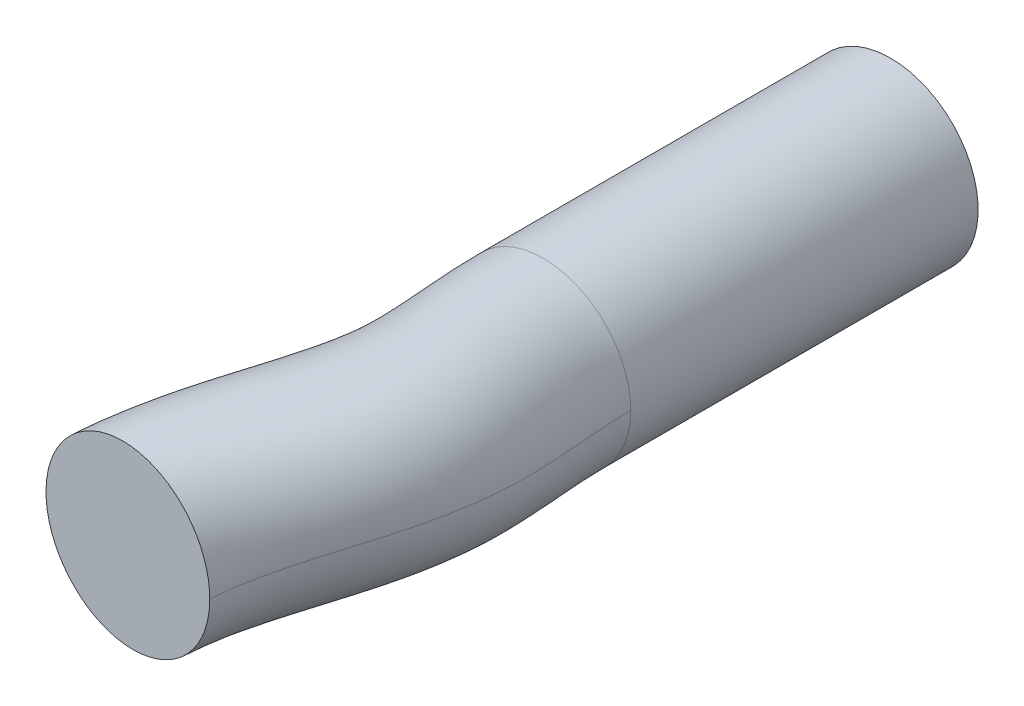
ISO-10303-21;
HEADER;
FILE_DESCRIPTION(('STEP AP214'),'2;1');
FILE_NAME('part.step','',(''),(''),'','','');
FILE_SCHEMA(('AUTOMOTIVE_DESIGN { 1 0 10303 214 1 1 1 1 }'));
ENDSEC;
DATA;
#1=APPLICATION_CONTEXT('core data for automotive mechanical design processes');
#2=APPLICATION_PROTOCOL_DEFINITION('international standard','automotive_design',2000,#1);
#3=PRODUCT_CONTEXT('',#1,'mechanical');
#4=PRODUCT('Part','Part','',(#3));
#5=PRODUCT_RELATED_PRODUCT_CATEGORY('part','',(#4));
#6=PRODUCT_DEFINITION_FORMATION('','',#4);
#7=PRODUCT_DEFINITION_CONTEXT('part definition',#1,'design');
#8=PRODUCT_DEFINITION('design','',#6,#7);
#9=PRODUCT_DEFINITION_SHAPE('','',#8);
#10=(LENGTH_UNIT() NAMED_UNIT(*) SI_UNIT(.MILLI.,.METRE.));
#11=(NAMED_UNIT(*) PLANE_ANGLE_UNIT() SI_UNIT($,.RADIAN.));
#12=(NAMED_UNIT(*) SI_UNIT($,.STERADIAN.) SOLID_ANGLE_UNIT());
#13=UNCERTAINTY_MEASURE_WITH_UNIT(LENGTH_MEASURE(1.E-05),#10,'distance_accuracy_value','');
#14=(GEOMETRIC_REPRESENTATION_CONTEXT(3) GLOBAL_UNCERTAINTY_ASSIGNED_CONTEXT((#13)) GLOBAL_UNIT_ASSIGNED_CONTEXT((#10,
#11,#12)) REPRESENTATION_CONTEXT('',''));
#15=CARTESIAN_POINT('',(0.,0.,0.));
#16=DIRECTION('',(0.,0.,1.));
#17=DIRECTION('',(1.,0.,0.));
#18=AXIS2_PLACEMENT_3D('',#15,#16,#17);
#19=CARTESIAN_POINT('',(-1.61,0.,24.5));
#20=DIRECTION('',(-0.0635520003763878,0.,0.997978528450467));
#21=DIRECTION('',(0.997978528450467,0.,0.0635520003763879));
#22=AXIS2_PLACEMENT_3D('',#19,#20,#21);
#23=PLANE('',#22);
#24=CARTESIAN_POINT('',(-4.60393558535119,7.16926518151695E-11,24.3093439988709));
#25=CARTESIAN_POINT('',(-4.60394365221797,0.0843776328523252,24.3093434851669));
#26=CARTESIAN_POINT('',(-4.60038301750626,0.168751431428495,24.3095702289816));
#27=CARTESIAN_POINT('',(-4.5861867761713,0.336895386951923,24.3104742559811));
#28=CARTESIAN_POINT('',(-4.57555150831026,0.420665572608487,24.3111515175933));
#29=CARTESIAN_POINT('',(-4.54727836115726,0.586956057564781,24.3129519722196));
#30=CARTESIAN_POINT('',(-4.52964540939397,0.669477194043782,24.3140748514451));
#31=CARTESIAN_POINT('',(-4.48751994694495,0.832717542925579,24.31675743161));
#32=CARTESIAN_POINT('',(-4.46302751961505,0.913436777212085,24.3183171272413));
#33=CARTESIAN_POINT('',(-4.37945974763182,1.15211016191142,24.3236387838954));
#34=CARTESIAN_POINT('',(-4.3102818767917,1.30665040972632,24.328044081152));
#35=CARTESIAN_POINT('',(-4.14706292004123,1.60178306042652,24.3384379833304));
#36=CARTESIAN_POINT('',(-4.05302671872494,1.74237819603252,24.3444262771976));
#37=CARTESIAN_POINT('',(-3.84272350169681,2.00578158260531,24.3578185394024));
#38=CARTESIAN_POINT('',(-3.72645599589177,2.12858944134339,24.3652225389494));
#39=CARTESIAN_POINT('',(-3.47497968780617,2.3529155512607,24.3812367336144));
#40=CARTESIAN_POINT('',(-3.33976800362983,2.45443055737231,24.3898471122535));
#41=CARTESIAN_POINT('',(-3.05426010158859,2.63326944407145,24.4080284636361));
#42=CARTESIAN_POINT('',(-2.90396454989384,2.71059439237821,24.4175993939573));
#43=CARTESIAN_POINT('',(-2.59256066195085,2.83885751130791,24.4374298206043));
#44=CARTESIAN_POINT('',(-2.4314530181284,2.88979736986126,24.447689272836));
#45=CARTESIAN_POINT('',(-2.10298780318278,2.96385438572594,24.468606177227));
#46=CARTESIAN_POINT('',(-1.93563010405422,2.98697097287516,24.4792636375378));
#47=CARTESIAN_POINT('',(-1.59940761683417,3.00471900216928,24.5006745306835));
#48=CARTESIAN_POINT('',(-1.43054279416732,2.9993497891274,24.5114279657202));
#49=CARTESIAN_POINT('',(-1.09613182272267,2.96029370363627,24.5327235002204));
#50=CARTESIAN_POINT('',(-0.930585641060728,2.92660711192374,24.5432656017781));
#51=CARTESIAN_POINT('',(-0.6074108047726,2.83181204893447,24.5638456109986));
#52=CARTESIAN_POINT('',(-0.449782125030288,2.77070366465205,24.5738835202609));
#53=CARTESIAN_POINT('',(-0.22283271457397,2.65990833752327,24.5883358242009));
#54=CARTESIAN_POINT('',(-0.148729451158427,2.61976214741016,24.5930547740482));
#55=CARTESIAN_POINT('',(-0.00415737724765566,2.53336005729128,24.6022612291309));
#56=CARTESIAN_POINT('',(0.0663122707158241,2.48710557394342,24.6067487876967));
#57=CARTESIAN_POINT('',(0.203081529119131,2.38883073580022,24.6154583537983));
#58=CARTESIAN_POINT('',(0.269382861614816,2.33681278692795,24.6196804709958));
#59=CARTESIAN_POINT('',(0.397430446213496,2.22733210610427,24.6278346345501));
#60=CARTESIAN_POINT('',(0.459172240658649,2.16986416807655,24.63176639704));
#61=CARTESIAN_POINT('',(0.636727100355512,1.99000567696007,24.6430732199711));
#62=CARTESIAN_POINT('',(0.745053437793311,1.86002810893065,24.6499715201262));
#63=CARTESIAN_POINT('',(0.938351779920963,1.58367857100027,24.662280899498));
#64=CARTESIAN_POINT('',(1.02332467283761,1.43730722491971,24.6676920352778));
#65=CARTESIAN_POINT('',(1.13150037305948,1.20865828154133,24.6745807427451));
#66=CARTESIAN_POINT('',(1.16436909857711,1.13084102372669,24.6766738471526));
#67=CARTESIAN_POINT('',(1.22342659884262,0.972751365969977,24.6804346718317));
#68=CARTESIAN_POINT('',(1.24962078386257,0.892481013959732,24.6821027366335));
#69=CARTESIAN_POINT('',(1.29513961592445,0.730100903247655,24.6850014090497));
#70=CARTESIAN_POINT('',(1.31447098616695,0.647993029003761,24.6862324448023));
#71=CARTESIAN_POINT('',(1.34616289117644,0.482452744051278,24.6882506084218));
#72=CARTESIAN_POINT('',(1.35852546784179,0.39902072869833,24.6890378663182));
#73=CARTESIAN_POINT('',(1.37288632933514,0.262839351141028,24.6899523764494));
#74=CARTESIAN_POINT('',(1.37703243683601,0.21030791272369,24.6902164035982));
#75=CARTESIAN_POINT('',(1.38255506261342,0.105186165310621,24.6905680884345));
#76=CARTESIAN_POINT('',(1.38393614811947,0.0525960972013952,24.6906560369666));
#77=CARTESIAN_POINT('',(1.38393558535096,-3.59087759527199E-11,24.6906560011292));
#78=B_SPLINE_CURVE_WITH_KNOTS('',3,(#24,#25,#26,#27,#28,#29,#30,#31,#32,#33,#34,#35,#36,#37,#38,
#39,#40,#41,#42,#43,#44,#45,#46,#47,#48,#49,#50,#51,#52,#53,#54,#55,#56,#57,#58,#59,#60,#61,#62,
#63,#64,#65,#66,#67,#68,#69,#70,#71,#72,#73,#74,#75,#76,#77),.UNSPECIFIED.,.F.,.F.,(4,2,2,2,2,2,
2,2,2,2,2,2,2,2,2,2,2,2,2,2,2,2,2,2,2,2,4),(0.,0.253050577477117,0.506089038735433,
0.758949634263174,1.01180715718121,1.5173105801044,2.02271474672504,2.52813005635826,
3.03362233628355,3.53909230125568,4.04452992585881,4.54997790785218,5.05543751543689,
5.56089211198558,6.06634510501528,6.31933241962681,6.57226116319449,6.82508471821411,
7.07815226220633,7.5836156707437,8.08905985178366,8.34230891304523,8.59535203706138,
8.84814657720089,9.10086700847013,9.25888633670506,9.4166444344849),.UNSPECIFIED.);
#79=CARTESIAN_POINT('',(-4.60393558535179,9.5590202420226E-11,24.309343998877));
#80=VERTEX_POINT('',#79);
#81=CARTESIAN_POINT('',(1.38393558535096,-3.63736818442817E-11,24.6906560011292));
#82=VERTEX_POINT('',#81);
#83=EDGE_CURVE('E70',#80,#82,#78,.T.);
#84=ORIENTED_EDGE('',*,*,#83,.F.);
#85=CARTESIAN_POINT('',(1.38393558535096,-3.68385877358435E-11,24.6906560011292));
#86=CARTESIAN_POINT('',(1.38394365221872,-0.0843776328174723,24.6906565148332));
#87=CARTESIAN_POINT('',(1.38038301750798,-0.168751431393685,24.6904297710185));
#88=CARTESIAN_POINT('',(1.36618677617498,-0.336895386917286,24.6895257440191));
#89=CARTESIAN_POINT('',(1.35555150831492,-0.420665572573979,24.688848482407));
#90=CARTESIAN_POINT('',(1.32727836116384,-0.586956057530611,24.6870480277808));
#91=CARTESIAN_POINT('',(1.30964540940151,-0.669477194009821,24.6859251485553));
#92=CARTESIAN_POINT('',(1.2675199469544,-0.83271754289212,24.6832425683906));
#93=CARTESIAN_POINT('',(1.24302751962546,-0.913436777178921,24.6816828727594));
#94=CARTESIAN_POINT('',(1.15945974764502,-1.15211016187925,24.6763612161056));
#95=CARTESIAN_POINT('',(1.09028187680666,-1.30665040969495,24.6719559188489));
#96=CARTESIAN_POINT('',(0.927062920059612,-1.60178306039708,24.6615620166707));
#97=CARTESIAN_POINT('',(0.833026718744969,-1.7423781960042,24.6555737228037));
#98=CARTESIAN_POINT('',(0.622723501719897,-2.00578158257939,24.6421814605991));
#99=CARTESIAN_POINT('',(0.506455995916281,-2.12858944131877,24.6347774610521));
#100=CARTESIAN_POINT('',(0.254979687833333,-2.35291555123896,24.6187632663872));
#101=CARTESIAN_POINT('',(0.119768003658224,-2.45443055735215,24.6101528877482));
#102=CARTESIAN_POINT('',(-0.165739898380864,-2.63326944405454,24.5919715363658));
#103=CARTESIAN_POINT('',(-0.316035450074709,-2.71059439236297,24.5824006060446));
#104=CARTESIAN_POINT('',(-0.627439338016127,-2.83885751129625,24.5625701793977));
#105=CARTESIAN_POINT('',(-0.788546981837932,-2.88979736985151,24.5523107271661));
#106=CARTESIAN_POINT('',(-1.11701219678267,-2.96385438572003,24.5313938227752));
#107=CARTESIAN_POINT('',(-1.28436989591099,-2.98697097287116,24.5207363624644));
#108=CARTESIAN_POINT('',(-1.6205923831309,-3.00471900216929,24.4993254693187));
#109=CARTESIAN_POINT('',(-1.78945720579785,-2.99934978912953,24.488572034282));
#110=CARTESIAN_POINT('',(-2.12386817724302,-2.96029370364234,24.4672764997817));
#111=CARTESIAN_POINT('',(-2.28941435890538,-2.92660711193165,24.456734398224));
#112=CARTESIAN_POINT('',(-2.61258919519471,-2.83181204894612,24.4361543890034));
#113=CARTESIAN_POINT('',(-2.7702178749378,-2.7707036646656,24.4261164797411));
#114=CARTESIAN_POINT('',(-2.99716728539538,-2.65990833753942,24.411664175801));
#115=CARTESIAN_POINT('',(-3.07127054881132,-2.61976214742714,24.4069452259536));
#116=CARTESIAN_POINT('',(-3.21584262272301,-2.53336005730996,24.3977387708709));
#117=CARTESIAN_POINT('',(-3.28631227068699,-2.48710557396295,24.393251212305));
#118=CARTESIAN_POINT('',(-3.42308152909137,-2.38883073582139,24.3845416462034));
#119=CARTESIAN_POINT('',(-3.48938286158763,-2.33681278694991,24.3803195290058));
#120=CARTESIAN_POINT('',(-3.61743044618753,-2.2273321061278,24.3721653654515));
#121=CARTESIAN_POINT('',(-3.67917224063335,-2.16986416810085,24.3682336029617));
#122=CARTESIAN_POINT('',(-3.85672710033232,-1.99000567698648,24.3569267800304));
#123=CARTESIAN_POINT('',(-3.96505343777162,-1.86002810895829,24.3500284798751));
#124=CARTESIAN_POINT('',(-4.15835177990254,-1.58367857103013,24.337719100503));
#125=CARTESIAN_POINT('',(-4.24332467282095,-1.43730722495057,24.3323079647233));
#126=CARTESIAN_POINT('',(-4.35150037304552,-1.20865828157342,24.3254192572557));
#127=CARTESIAN_POINT('',(-4.38436909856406,-1.13084102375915,24.3233261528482));
#128=CARTESIAN_POINT('',(-4.44342659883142,-0.9727513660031,24.3195653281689));
#129=CARTESIAN_POINT('',(-4.46962078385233,-0.892481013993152,24.3178972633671));
#130=CARTESIAN_POINT('',(-4.51513961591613,-0.730100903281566,24.3149985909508));
#131=CARTESIAN_POINT('',(-4.5344709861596,-0.647993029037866,24.313767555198));
#132=CARTESIAN_POINT('',(-4.56616289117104,-0.482452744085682,24.3117493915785));
#133=CARTESIAN_POINT('',(-4.57852546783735,-0.399020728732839,24.3109621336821));
#134=CARTESIAN_POINT('',(-4.59288632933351,-0.262839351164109,24.3100476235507));
#135=CARTESIAN_POINT('',(-4.59703243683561,-0.210307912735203,24.3097835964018));
#136=CARTESIAN_POINT('',(-4.60255506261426,-0.105186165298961,24.3094319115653));
#137=CARTESIAN_POINT('',(-4.60393614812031,-0.0525960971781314,24.3093439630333));
#138=CARTESIAN_POINT('',(-4.60393558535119,7.07628400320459E-11,24.3093439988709));
#139=B_SPLINE_CURVE_WITH_KNOTS('',3,(#85,#86,#87,#88,#89,#90,#91,#92,#93,#94,#95,#96,#97,#98,
#99,#100,#101,#102,#103,#104,#105,#106,#107,#108,#109,#110,#111,#112,#113,#114,#115,#116,#117,
#118,#119,#120,#121,#122,#123,#124,#125,#126,#127,#128,#129,#130,#131,#132,#133,#134,#135,#136,
#137,#138),.UNSPECIFIED.,.F.,.F.,(4,2,2,2,2,2,2,2,2,2,2,2,2,2,2,2,2,2,2,2,2,2,2,2,2,2,4),(0.,
0.253050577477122,0.506089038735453,0.758949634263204,1.01180715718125,1.51731058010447,
2.02271474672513,2.52813005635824,3.0336223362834,3.53909230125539,4.04452992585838,
4.54997790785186,5.05543751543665,5.56089211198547,6.0663451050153,6.3193324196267,
6.57226116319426,6.82508471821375,7.07815226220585,7.58361567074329,8.08905985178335,
8.34230891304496,8.59535203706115,8.84814657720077,9.10086700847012,9.2588863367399,
9.41664443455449),.UNSPECIFIED.);
#140=EDGE_CURVE('E81',#82,#80,#139,.T.);
#141=ORIENTED_EDGE('',*,*,#140,.F.);
#142=EDGE_LOOP('',(#84,#141));
#143=FACE_BOUND('',#142,.T.);
#144=ADVANCED_FACE('F41',(#143),#23,.T.);
#145=CARTESIAN_POINT('',(2.995071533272,-0.188373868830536,11.82115905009));
#146=CARTESIAN_POINT('',(2.994560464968,-0.188372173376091,11.84797485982));
#147=CARTESIAN_POINT('',(2.99116071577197,-0.188368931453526,12.10644419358));
#148=CARTESIAN_POINT('',(3.005885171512,-0.18837306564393,12.53308450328));
#149=CARTESIAN_POINT('',(3.04929213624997,-0.188371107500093,13.15241534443));
#150=CARTESIAN_POINT('',(3.091733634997,-0.188371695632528,13.67756940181));
#151=CARTESIAN_POINT('',(3.13762643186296,-0.188371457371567,14.26809818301));
#152=CARTESIAN_POINT('',(3.169675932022,-0.188371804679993,14.79749991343));
#153=CARTESIAN_POINT('',(3.185866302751,-0.188371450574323,15.26125536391));
#154=CARTESIAN_POINT('',(3.19096352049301,-0.188371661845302,15.62552304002));
#155=CARTESIAN_POINT('',(3.18697301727,-0.188371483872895,15.95041540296));
#156=CARTESIAN_POINT('',(3.177139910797,-0.188371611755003,16.22517259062));
#157=CARTESIAN_POINT('',(3.16625326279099,-0.188371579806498,16.42751721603));
#158=CARTESIAN_POINT('',(3.15239900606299,-0.188371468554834,16.62142197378));
#159=CARTESIAN_POINT('',(3.131383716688,-0.188371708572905,16.86402324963));
#160=CARTESIAN_POINT('',(3.097471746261,-0.188371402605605,17.17156001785));
#161=CARTESIAN_POINT('',(3.045283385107,-0.188371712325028,17.5452194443));
#162=CARTESIAN_POINT('',(2.962586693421,-0.188371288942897,18.03764010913));
#163=CARTESIAN_POINT('',(2.83489038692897,-0.188372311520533,18.65434636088));
#164=CARTESIAN_POINT('',(2.60159956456,-0.188370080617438,19.59031650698));
#165=CARTESIAN_POINT('',(2.34207172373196,-0.188373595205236,20.47053132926));
#166=CARTESIAN_POINT('',(2.09081722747,-0.188370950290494,21.30130918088));
#167=CARTESIAN_POINT('',(1.93733894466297,-0.188371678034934,21.82245606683));
#168=CARTESIAN_POINT('',(1.81780512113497,-0.188371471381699,22.25488787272));
#169=CARTESIAN_POINT('',(1.72851348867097,-0.1883715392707,22.59805313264));
#170=CARTESIAN_POINT('',(1.643552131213,-0.18837184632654,22.95184704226));
#171=CARTESIAN_POINT('',(1.542612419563,-0.188371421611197,23.41879245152));
#172=CARTESIAN_POINT('',(1.440268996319,-0.188371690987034,24.00633600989));
#173=CARTESIAN_POINT('',(1.39018297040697,-0.188371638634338,24.48320854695));
#174=CARTESIAN_POINT('',(1.375003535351,-0.188371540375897,24.73948832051));
#175=CARTESIAN_POINT('',(1.373659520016,-0.1883714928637,24.76404431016));
#176=CARTESIAN_POINT('',(3.11097590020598,1.65420147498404,11.82330939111));
#177=CARTESIAN_POINT('',(3.110472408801,1.65418658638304,11.84968835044));
#178=CARTESIAN_POINT('',(3.10712213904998,1.654158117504,12.10412738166));
#179=CARTESIAN_POINT('',(3.12164237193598,1.65419442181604,12.52657836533));
#180=CARTESIAN_POINT('',(3.164867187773,1.65417722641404,13.14340932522));
#181=CARTESIAN_POINT('',(3.20727327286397,1.65418239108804,13.66814724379));
#182=CARTESIAN_POINT('',(3.25326277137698,1.654180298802,14.25987295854));
#183=CARTESIAN_POINT('',(3.285467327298,1.654183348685,14.79168728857));
#184=CARTESIAN_POINT('',(3.30176259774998,1.65418023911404,15.2583803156));
#185=CARTESIAN_POINT('',(3.30690038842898,1.654182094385,15.62536005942));
#186=CARTESIAN_POINT('',(3.302877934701,1.654180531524,15.95303552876));
#187=CARTESIAN_POINT('',(3.29295412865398,1.654181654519,16.23035076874));
#188=CARTESIAN_POINT('',(3.281959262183,1.65418137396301,16.43471328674));
#189=CARTESIAN_POINT('',(3.267965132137,1.65418039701,16.63057453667));
#190=CARTESIAN_POINT('',(3.246743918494,1.654182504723,16.87555033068));
#191=CARTESIAN_POINT('',(3.21251315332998,1.65417981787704,17.18596454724));
#192=CARTESIAN_POINT('',(3.15986605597,1.65418253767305,17.56289800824));
#193=CARTESIAN_POINT('',(3.07649770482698,1.65417881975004,18.05930118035));
#194=CARTESIAN_POINT('',(2.94789693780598,1.654187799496,18.68032928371));
#195=CARTESIAN_POINT('',(2.71332247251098,1.65416820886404,19.62137534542));
#196=CARTESIAN_POINT('',(2.45304587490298,1.65419907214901,20.50403947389));
#197=CARTESIAN_POINT('',(2.20181942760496,1.654175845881,21.3347295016));
#198=CARTESIAN_POINT('',(2.04875105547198,1.65418223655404,21.85450227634));
#199=CARTESIAN_POINT('',(1.929759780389,1.654180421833,22.28497898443));
#200=CARTESIAN_POINT('',(1.84096055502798,1.654181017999,22.6262576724));
#201=CARTESIAN_POINT('',(1.75656712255,1.65418371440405,22.97769756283));
#202=CARTESIAN_POINT('',(1.65643150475,1.65417998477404,23.44094036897));
#203=CARTESIAN_POINT('',(1.55512764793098,1.65418235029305,24.02265251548));
#204=CARTESIAN_POINT('',(1.50570160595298,1.65418189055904,24.49348095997));
#205=CARTESIAN_POINT('',(1.490734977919,1.65418102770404,24.74616906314));
#206=CARTESIAN_POINT('',(1.48940994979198,1.65418061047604,24.77037778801));
#207=CARTESIAN_POINT('',(1.847377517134,3.000036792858,11.79986620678));
#208=CARTESIAN_POINT('',(1.84679142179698,3.000009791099,11.83100774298));
#209=CARTESIAN_POINT('',(1.84290172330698,2.999958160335,12.12938544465));
#210=CARTESIAN_POINT('',(1.859648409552,3.000024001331,12.59750878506));
#211=CARTESIAN_POINT('',(1.904859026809,2.999992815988,13.24159364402));
#212=CARTESIAN_POINT('',(1.947651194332,3.00000218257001,13.77086834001));
#213=CARTESIAN_POINT('',(1.99258644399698,2.99999838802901,14.34954499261));
#214=CARTESIAN_POINT('',(2.02310056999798,3.000003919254,14.85505697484));
#215=CARTESIAN_POINT('',(2.03825221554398,2.99999827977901,15.28972431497));
#216=CARTESIAN_POINT('',(2.04294767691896,3.000001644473,15.62713688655));
#217=CARTESIAN_POINT('',(2.03927355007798,2.99999881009,15.92447071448));
#218=CARTESIAN_POINT('',(2.0303385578,3.00000084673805,16.17389786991));
#219=CARTESIAN_POINT('',(2.02052349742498,3.000000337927,16.35626116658));
#220=CARTESIAN_POINT('',(2.00805427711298,2.999998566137,16.53079258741));
#221=CARTESIAN_POINT('',(1.98907806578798,3.00000238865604,16.74988120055));
#222=CARTESIAN_POINT('',(1.958322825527,2.99999751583,17.02892525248));
#223=CARTESIAN_POINT('',(1.910676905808,3.00000244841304,17.37016493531));
#224=CARTESIAN_POINT('',(1.83463103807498,2.999995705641,17.82315050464));
#225=CARTESIAN_POINT('',(1.715890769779,3.000011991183,18.39706144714));
#226=CARTESIAN_POINT('',(1.49531067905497,2.999976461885,19.2827694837));
#227=CARTESIAN_POINT('',(1.243197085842,3.000032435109,20.1387310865));
#228=CARTESIAN_POINT('',(0.991664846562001,2.999990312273,20.97037857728));
#229=CARTESIAN_POINT('',(0.834127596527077,3.00000190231,21.50513201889));
#230=CARTESIAN_POINT('',(0.709221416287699,2.99999861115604,21.95692335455));
#231=CARTESIAN_POINT('',(0.615053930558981,2.99999969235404,22.31876959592));
#232=CARTESIAN_POINT('',(0.5244689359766,3.000004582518,22.69587318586));
#233=CARTESIAN_POINT('',(0.415567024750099,2.99999781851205,23.19948205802));
#234=CARTESIAN_POINT('',(0.302929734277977,3.00000210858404,23.84476870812));
#235=CARTESIAN_POINT('',(0.246308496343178,3.000001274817,24.38149031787));
#236=CARTESIAN_POINT('',(0.229021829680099,2.999999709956,24.67333508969));
#237=CARTESIAN_POINT('',(0.227489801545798,2.999998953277,24.70132972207));
#238=CARTESIAN_POINT('',(0.00148791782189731,3.000036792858,11.76561993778));
#239=CARTESIAN_POINT('',(0.000781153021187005,3.000009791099,11.80371874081));
#240=CARTESIAN_POINT('',(-0.00389655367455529,2.99995816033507,12.16628292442));
#241=CARTESIAN_POINT('',(0.0161025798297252,3.00002400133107,12.70112535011));
#242=CARTESIAN_POINT('',(0.0642140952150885,2.99999281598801,13.38502324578));
#243=CARTESIAN_POINT('',(0.107570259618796,3.00000218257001,13.92092535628));
#244=CARTESIAN_POINT('',(0.150965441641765,2.999998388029,14.48053967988));
#245=CARTESIAN_POINT('',(0.1790101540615,3.00000391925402,14.94762867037));
#246=CARTESIAN_POINT('',(0.192491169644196,2.99999827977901,15.3355122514));
#247=CARTESIAN_POINT('',(0.196540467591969,3.00000164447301,15.62973251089));
#248=CARTESIAN_POINT('',(0.1933751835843,2.99999881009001,15.88274266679));
#249=CARTESIAN_POINT('',(0.185884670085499,3.00000084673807,16.09143035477));
#250=CARTESIAN_POINT('',(0.177793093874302,3.000000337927,16.24165675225));
#251=CARTESIAN_POINT('',(0.167551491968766,2.99999856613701,16.38502913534));
#252=CARTESIAN_POINT('',(0.15185482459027,3.00000238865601,16.56630124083));
#253=CARTESIAN_POINT('',(0.126176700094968,2.99999751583,16.7995191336));
#254=CARTESIAN_POINT('',(0.0858365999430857,3.00000244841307,17.0886166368));
#255=CARTESIAN_POINT('',(0.020487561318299,2.999995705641,17.47817691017));
#256=CARTESIAN_POINT('',(-0.0838482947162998,3.00001199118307,17.98325816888));
#257=CARTESIAN_POINT('',(-0.283985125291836,2.99997646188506,18.78812731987));
#258=CARTESIAN_POINT('',(-0.524174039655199,3.00003243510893,19.60508134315));
#259=CARTESIAN_POINT('',(-0.776152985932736,2.999990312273,20.43812751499));
#260=CARTESIAN_POINT('',(-0.940218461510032,3.00000190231,20.99476501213));
#261=CARTESIAN_POINT('',(-1.073765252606,2.99999861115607,21.47769317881));
#262=CARTESIAN_POINT('',(-1.175774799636,2.99999969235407,21.86958491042));
#263=CARTESIAN_POINT('',(-1.275404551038,3.00000458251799,22.28417854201));
#264=CARTESIAN_POINT('',(-1.397112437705,2.99999781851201,22.84675496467));
#265=CARTESIAN_POINT('',(-1.526305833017,3.00000210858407,23.58491251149));
#266=CARTESIAN_POINT('',(-1.593437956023,3.00000127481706,24.21789216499));
#267=CARTESIAN_POINT('',(-1.614113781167,2.99999970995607,24.56693777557));
#268=CARTESIAN_POINT('',(-1.61594819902,2.999998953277,24.60046293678));
#269=CARTESIAN_POINT('',(-1.84440168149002,3.00003679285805,11.73137366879));
#270=CARTESIAN_POINT('',(-1.845229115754,3.000009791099,11.77642973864));
#271=CARTESIAN_POINT('',(-1.850694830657,2.99995816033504,12.20318040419));
#272=CARTESIAN_POINT('',(-1.827443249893,3.000024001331,12.80474191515));
#273=CARTESIAN_POINT('',(-1.77643083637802,2.99999281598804,13.52845284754));
#274=CARTESIAN_POINT('',(-1.732510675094,3.00000218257,14.07098237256));
#275=CARTESIAN_POINT('',(-1.690655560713,2.999998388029,14.61153436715));
#276=CARTESIAN_POINT('',(-1.66508026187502,3.00000391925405,15.0402003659));
#277=CARTESIAN_POINT('',(-1.653269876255,2.999998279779,15.38130018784));
#278=CARTESIAN_POINT('',(-1.64986674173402,3.00000164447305,15.63232813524));
#279=CARTESIAN_POINT('',(-1.65252318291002,2.99999881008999,15.8410146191));
#280=CARTESIAN_POINT('',(-1.65856921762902,3.000000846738,16.00896283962));
#281=CARTESIAN_POINT('',(-1.664937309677,3.000000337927,16.12705233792));
#282=CARTESIAN_POINT('',(-1.67295129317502,2.999998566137,16.23926568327));
#283=CARTESIAN_POINT('',(-1.685368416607,3.00000238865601,16.38272128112));
#284=CARTESIAN_POINT('',(-1.705969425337,2.99999751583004,16.57011301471));
#285=CARTESIAN_POINT('',(-1.739003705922,3.000002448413,16.80706833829));
#286=CARTESIAN_POINT('',(-1.79365591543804,2.999995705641,17.1332033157));
#287=CARTESIAN_POINT('',(-1.883587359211,3.000011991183,17.56945489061));
#288=CARTESIAN_POINT('',(-2.063280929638,2.999976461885,18.29348515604));
#289=CARTESIAN_POINT('',(-2.291545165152,3.00003243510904,19.0714315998));
#290=CARTESIAN_POINT('',(-2.543970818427,2.999990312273,19.90587645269));
#291=CARTESIAN_POINT('',(-2.71456451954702,3.00000190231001,20.48439800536));
#292=CARTESIAN_POINT('',(-2.856751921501,2.999998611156,20.99846300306));
#293=CARTESIAN_POINT('',(-2.96660352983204,2.999999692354,21.42040022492));
#294=CARTESIAN_POINT('',(-3.075278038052,3.00000458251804,21.87248389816));
#295=CARTESIAN_POINT('',(-3.20979190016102,2.999997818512,22.49402787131));
#296=CARTESIAN_POINT('',(-3.355541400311,3.00000210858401,23.32505631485));
#297=CARTESIAN_POINT('',(-3.43318440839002,3.00000127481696,24.0542940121));
#298=CARTESIAN_POINT('',(-3.457249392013,2.999999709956,24.46054046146));
#299=CARTESIAN_POINT('',(-3.45938619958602,2.999998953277,24.4995961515));
#300=CARTESIAN_POINT('',(-3.10800006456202,1.654201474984,11.70793048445));
#301=CARTESIAN_POINT('',(-3.10891010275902,1.654186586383,11.75774913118));
#302=CARTESIAN_POINT('',(-3.11491524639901,1.654158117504,12.22843846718));
#303=CARTESIAN_POINT('',(-3.08943721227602,1.65419442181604,12.87567233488));
#304=CARTESIAN_POINT('',(-3.036438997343,1.654177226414,13.62663716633));
#305=CARTESIAN_POINT('',(-2.992132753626,1.65418239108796,14.17370346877));
#306=CARTESIAN_POINT('',(-2.95133188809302,1.654180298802,14.70120640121));
#307=CARTESIAN_POINT('',(-2.92744701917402,1.654183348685,15.10357005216));
#308=CARTESIAN_POINT('',(-2.916780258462,1.654180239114,15.41264418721));
#309=CARTESIAN_POINT('',(-2.91381945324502,1.65418209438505,15.63410496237));
#310=CARTESIAN_POINT('',(-2.916127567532,1.654180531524,15.81244980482));
#311=CARTESIAN_POINT('',(-2.921184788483,1.654181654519,15.9525099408));
#312=CARTESIAN_POINT('',(-2.92637307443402,1.654181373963,16.04860021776));
#313=CARTESIAN_POINT('',(-2.93286214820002,1.65418039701,16.13948373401));
#314=CARTESIAN_POINT('',(-2.943034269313,1.654182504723,16.25705215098));
#315=CARTESIAN_POINT('',(-2.96015975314,1.654179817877,16.41307371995));
#316=CARTESIAN_POINT('',(-2.988192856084,1.65418253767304,16.61433526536));
#317=CARTESIAN_POINT('',(-3.03552258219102,1.65417881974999,16.89705263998));
#318=CARTESIAN_POINT('',(-3.115593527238,1.65418779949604,17.28618705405));
#319=CARTESIAN_POINT('',(-3.281292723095,1.654168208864,17.95487929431));
#320=CARTESIAN_POINT('',(-3.50139395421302,1.65419907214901,18.7061232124));
#321=CARTESIAN_POINT('',(-3.75412539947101,1.65417584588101,19.54152552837));
#322=CARTESIAN_POINT('',(-3.929187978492,1.654182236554,20.13502774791));
#323=CARTESIAN_POINT('',(-4.07729028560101,1.65418042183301,20.67040737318));
#324=CARTESIAN_POINT('',(-4.19251015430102,1.654181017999,21.11291214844));
#325=CARTESIAN_POINT('',(-4.307376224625,1.654183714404,21.59065952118));
#326=CARTESIAN_POINT('',(-4.45065638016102,1.654179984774,22.25256956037));
#327=CARTESIAN_POINT('',(-4.60773931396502,1.654182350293,23.14717250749));
#328=CARTESIAN_POINT('',(-4.692577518,1.654181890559,23.94230337));
#329=CARTESIAN_POINT('',(-4.718962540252,1.65418102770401,24.387706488));
#330=CARTESIAN_POINT('',(-4.721306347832,1.654180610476,24.43054808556));
#331=CARTESIAN_POINT('',(-2.99209569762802,-0.188373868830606,11.71008082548));
#332=CARTESIAN_POINT('',(-2.99299815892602,-0.188372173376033,11.7594626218));
#333=CARTESIAN_POINT('',(-2.99895382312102,-0.188368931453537,12.22612165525));
#334=CARTESIAN_POINT('',(-2.973680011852,-0.18837306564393,12.86916619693));
#335=CARTESIAN_POINT('',(-2.920863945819,-0.188371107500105,13.61763114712));
#336=CARTESIAN_POINT('',(-2.87659311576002,-0.188371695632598,14.16428131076));
#337=CARTESIAN_POINT('',(-2.835695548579,-0.188371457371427,14.69298117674));
#338=CARTESIAN_POINT('',(-2.811655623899,-0.188371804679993,15.09775742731));
#339=CARTESIAN_POINT('',(-2.800883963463,-0.188371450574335,15.40976913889));
#340=CARTESIAN_POINT('',(-2.79788258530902,-0.188371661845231,15.63394198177));
#341=CARTESIAN_POINT('',(-2.800222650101,-0.188371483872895,15.81506993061));
#342=CARTESIAN_POINT('',(-2.805370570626,-0.188371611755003,15.95768811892));
#343=CARTESIAN_POINT('',(-2.81066707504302,-0.188371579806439,16.05579628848));
#344=CARTESIAN_POINT('',(-2.817296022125,-0.188371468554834,16.1486362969));
#345=CARTESIAN_POINT('',(-2.827674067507,-0.188371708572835,16.26857923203));
#346=CARTESIAN_POINT('',(-2.84511834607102,-0.188371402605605,16.42747824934));
#347=CARTESIAN_POINT('',(-2.87361018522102,-0.188371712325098,16.6320138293));
#348=CARTESIAN_POINT('',(-2.92161157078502,-0.188371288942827,16.91871371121));
#349=CARTESIAN_POINT('',(-3.00258697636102,-0.188372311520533,17.31216997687));
#350=CARTESIAN_POINT('',(-3.16956981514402,-0.188370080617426,17.98593813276));
#351=CARTESIAN_POINT('',(-3.390419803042,-0.188373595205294,18.73963135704));
#352=CARTESIAN_POINT('',(-3.64312319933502,-0.188370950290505,19.57494584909));
#353=CARTESIAN_POINT('',(-3.817775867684,-0.188371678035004,20.16707395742));
#354=CARTESIAN_POINT('',(-3.96533562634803,-0.188371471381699,20.70049848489));
#355=CARTESIAN_POINT('',(-4.08006308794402,-0.1883715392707,21.14111668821));
#356=CARTESIAN_POINT('',(-4.19436123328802,-0.188371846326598,21.61651004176));
#357=CARTESIAN_POINT('',(-4.33683729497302,-0.188371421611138,22.27471747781));
#358=CARTESIAN_POINT('',(-4.492880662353,-0.188371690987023,23.16348901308));
#359=CARTESIAN_POINT('',(-4.57705888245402,-0.188371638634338,23.95257578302));
#360=CARTESIAN_POINT('',(-4.603231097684,-0.188371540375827,24.39438723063));
#361=CARTESIAN_POINT('',(-4.605555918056,-0.18837149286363,24.43688156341));
#362=(BOUNDED_SURFACE() B_SPLINE_SURFACE(3,3,((#145,#146,#147,#148,#149,#150,#151,#152,#153,
#154,#155,#156,#157,#158,#159,#160,#161,#162,#163,#164,#165,#166,#167,#168,#169,#170,#171,#172,
#173,#174,#175),(#176,#177,#178,#179,#180,#181,#182,#183,#184,#185,#186,#187,#188,#189,#190,
#191,#192,#193,#194,#195,#196,#197,#198,#199,#200,#201,#202,#203,#204,#205,#206),(#207,#208,
#209,#210,#211,#212,#213,#214,#215,#216,#217,#218,#219,#220,#221,#222,#223,#224,#225,#226,#227,
#228,#229,#230,#231,#232,#233,#234,#235,#236,#237),(#238,#239,#240,#241,#242,#243,#244,#245,
#246,#247,#248,#249,#250,#251,#252,#253,#254,#255,#256,#257,#258,#259,#260,#261,#262,#263,#264,
#265,#266,#267,#268),(#269,#270,#271,#272,#273,#274,#275,#276,#277,#278,#279,#280,#281,#282,
#283,#284,#285,#286,#287,#288,#289,#290,#291,#292,#293,#294,#295,#296,#297,#298,#299),(#300,
#301,#302,#303,#304,#305,#306,#307,#308,#309,#310,#311,#312,#313,#314,#315,#316,#317,#318,#319,
#320,#321,#322,#323,#324,#325,#326,#327,#328,#329,#330),(#331,#332,#333,#334,#335,#336,#337,
#338,#339,#340,#341,#342,#343,#344,#345,#346,#347,#348,#349,#350,#351,#352,#353,#354,#355,#356,
#357,#358,#359,#360,#361)),.UNSPECIFIED.,.F.,.F.,.F.) B_SPLINE_SURFACE_WITH_KNOTS((4,3,4),(4,1,
1,1,1,1,1,1,1,1,1,1,1,1,1,1,1,1,1,1,1,1,1,1,1,1,1,1,4),(0.,1.,2.),(-0.009020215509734,0.,
0.07675610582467,0.1166692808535,0.1599085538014,0.2017969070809,0.2471759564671,
0.2689579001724,0.2925550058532,0.316152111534,0.328422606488,0.3417156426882,0.3516042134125,
0.3623168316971,0.3846347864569,0.4069527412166,0.4311305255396,0.4776262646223,0.5279966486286,
0.6248627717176,0.6752331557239,0.7298010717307,0.7596829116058,0.7920549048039,0.824426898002,
0.8594965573,0.926938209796,1.,1.007753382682),
.UNSPECIFIED.) GEOMETRIC_REPRESENTATION_ITEM() RATIONAL_B_SPLINE_SURFACE(((1.187262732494,
1.187262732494,1.187262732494,1.187262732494,1.187262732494,1.187262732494,1.187262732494,
1.187262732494,1.187262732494,1.187262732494,1.187262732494,1.187262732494,1.187262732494,
1.187262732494,1.187262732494,1.187262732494,1.187262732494,1.187262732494,1.187262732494,
1.187262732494,1.187262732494,1.187262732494,1.187262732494,1.187262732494,1.187262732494,
1.187262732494,1.187262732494,1.187262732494,1.187262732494,1.187262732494,1.187262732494),
(0.9375790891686,0.9375790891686,0.9375790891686,0.9375790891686,0.9375790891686,
0.9375790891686,0.9375790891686,0.9375790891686,0.9375790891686,0.9375790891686,0.9375790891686,
0.9375790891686,0.9375790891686,0.9375790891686,0.9375790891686,0.9375790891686,0.9375790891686,
0.9375790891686,0.9375790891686,0.9375790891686,0.9375790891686,0.9375790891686,0.9375790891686,
0.9375790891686,0.9375790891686,0.9375790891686,0.9375790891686,0.9375790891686,0.9375790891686,
0.9375790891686,0.9375790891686),(0.9375790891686,0.9375790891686,0.9375790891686,
0.9375790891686,0.9375790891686,0.9375790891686,0.9375790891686,0.9375790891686,0.9375790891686,
0.9375790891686,0.9375790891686,0.9375790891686,0.9375790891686,0.9375790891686,0.9375790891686,
0.9375790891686,0.9375790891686,0.9375790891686,0.9375790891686,0.9375790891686,0.9375790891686,
0.9375790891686,0.9375790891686,0.9375790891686,0.9375790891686,0.9375790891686,0.9375790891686,
0.9375790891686,0.9375790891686,0.9375790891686,0.9375790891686),(1.187262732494,1.187262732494,
1.187262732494,1.187262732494,1.187262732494,1.187262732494,1.187262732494,1.187262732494,
1.187262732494,1.187262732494,1.187262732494,1.187262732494,1.187262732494,1.187262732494,
1.187262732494,1.187262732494,1.187262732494,1.187262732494,1.187262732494,1.187262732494,
1.187262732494,1.187262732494,1.187262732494,1.187262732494,1.187262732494,1.187262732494,
1.187262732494,1.187262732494,1.187262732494,1.187262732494,1.187262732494),(0.9375790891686,
0.9375790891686,0.9375790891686,0.9375790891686,0.9375790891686,0.9375790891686,0.9375790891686,
0.9375790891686,0.9375790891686,0.9375790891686,0.9375790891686,0.9375790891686,0.9375790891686,
0.9375790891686,0.9375790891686,0.9375790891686,0.9375790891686,0.9375790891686,0.9375790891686,
0.9375790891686,0.9375790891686,0.9375790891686,0.9375790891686,0.9375790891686,0.9375790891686,
0.9375790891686,0.9375790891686,0.9375790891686,0.9375790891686,0.9375790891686,
0.9375790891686),(0.9375790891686,0.9375790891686,0.9375790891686,0.9375790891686,
0.9375790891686,0.9375790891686,0.9375790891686,0.9375790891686,0.9375790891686,0.9375790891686,
0.9375790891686,0.9375790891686,0.9375790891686,0.9375790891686,0.9375790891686,0.9375790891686,
0.9375790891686,0.9375790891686,0.9375790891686,0.9375790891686,0.9375790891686,0.9375790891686,
0.9375790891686,0.9375790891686,0.9375790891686,0.9375790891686,0.9375790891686,0.9375790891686,
0.9375790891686,0.9375790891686,0.9375790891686),(1.187262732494,1.187262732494,1.187262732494,
1.187262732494,1.187262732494,1.187262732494,1.187262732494,1.187262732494,1.187262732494,
1.187262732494,1.187262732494,1.187262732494,1.187262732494,1.187262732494,1.187262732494,
1.187262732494,1.187262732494,1.187262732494,1.187262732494,1.187262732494,1.187262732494,
1.187262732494,1.187262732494,1.187262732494,1.187262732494,1.187262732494,1.187262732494,
1.187262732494,1.187262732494,1.187262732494,1.187262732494))) REPRESENTATION_ITEM('') SURFACE());
#363=CARTESIAN_POINT('',(3.00099036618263,0.,11.821268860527));
#364=CARTESIAN_POINT('',(3.00047968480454,0.,11.8480623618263));
#365=CARTESIAN_POINT('',(2.99708246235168,0.,12.1063258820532));
#366=CARTESIAN_POINT('',(3.01179648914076,0.,12.5327522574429));
#367=CARTESIAN_POINT('',(3.05519415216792,0.,13.1519554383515));
#368=CARTESIAN_POINT('',(3.09763384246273,0.,13.6770882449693));
#369=CARTESIAN_POINT('',(3.1435315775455,0.,14.2676781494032));
#370=CARTESIAN_POINT('',(3.175588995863,0.,14.7972030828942));
#371=CARTESIAN_POINT('',(3.19178472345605,0.,15.2611085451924));
#372=CARTESIAN_POINT('',(3.19688401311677,0.,15.6255147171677));
#373=CARTESIAN_POINT('',(3.19289187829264,0.,15.9505492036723));
#374=CARTESIAN_POINT('',(3.1830541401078,0.,16.2254370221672));
#375=CARTESIAN_POINT('',(3.17216196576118,0.,16.4278846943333));
#376=CARTESIAN_POINT('',(3.1583005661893,0.,16.621889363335));
#377=CARTESIAN_POINT('',(3.13727476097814,0.,16.8646118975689));
#378=CARTESIAN_POINT('',(3.10334651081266,0.,17.1722956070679));
#379=CARTESIAN_POINT('',(3.05113472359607,0.,17.5461222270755));
#380=CARTESIAN_POINT('',(2.96840373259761,0.,18.0387462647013));
#381=CARTESIAN_POINT('',(2.84066123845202,0.,18.655673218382));
#382=CARTESIAN_POINT('',(2.60730486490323,0.,19.5919025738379));
#383=CARTESIAN_POINT('',(2.34773878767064,0.,20.4722424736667));
#384=CARTESIAN_POINT('',(2.09648572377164,0.,21.3030158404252));
#385=CARTESIAN_POINT('',(1.94302837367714,0.,21.824092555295));
#386=CARTESIAN_POINT('',(1.82352225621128,0.,22.25642452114));
#387=CARTESIAN_POINT('',(1.73425576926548,0.,22.5994934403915));
#388=CARTESIAN_POINT('',(1.64932341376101,0.,22.9531671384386));
#389=CARTESIAN_POINT('',(1.54842476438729,0.,23.4199234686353));
#390=CARTESIAN_POINT('',(1.44613442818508,0.,24.0071692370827));
#391=CARTESIAN_POINT('',(1.39608210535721,0.,24.4837331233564));
#392=CARTESIAN_POINT('',(1.3809135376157,0.,24.739829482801));
#393=CARTESIAN_POINT('',(1.37957049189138,0.,24.7643677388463));
#394=B_SPLINE_CURVE_WITH_KNOTS('',3,(#363,#364,#365,#366,#367,#368,#369,#370,#371,#372,#373,
#374,#375,#376,#377,#378,#379,#380,#381,#382,#383,#384,#385,#386,#387,#388,#389,#390,#391,#392,
#393),.UNSPECIFIED.,.F.,.F.,(4,1,1,1,1,1,1,1,1,1,1,1,1,1,1,1,1,1,1,1,1,1,1,1,1,1,1,1,4),
(-0.009020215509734,0.,0.07675610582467,0.1166692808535,0.1599085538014,0.2017969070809,
0.2471759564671,0.2689579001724,0.2925550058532,0.316152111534,0.328422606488,0.3417156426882,
0.3516042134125,0.3623168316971,0.3846347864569,0.4069527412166,0.4311305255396,0.4776262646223,
0.5279966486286,0.6248627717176,0.6752331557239,0.7298010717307,0.7596829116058,0.7920549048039,
0.824426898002,0.8594965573,0.926938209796,1.,1.007753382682),.UNSPECIFIED.);
#395=CARTESIAN_POINT('',(3.00000432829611,0.,11.8913713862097));
#396=VERTEX_POINT('',#395);
#397=EDGE_CURVE('E74',#396,#82,#394,.T.);
#398=CARTESIAN_POINT('',(3.00000865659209,0.,11.8913714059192));
#399=CARTESIAN_POINT('',(3.00000913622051,0.038865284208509,11.8913720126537));
#400=CARTESIAN_POINT('',(2.99925337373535,0.0777310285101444,11.8913765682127));
#401=CARTESIAN_POINT('',(2.99605932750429,0.159856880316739,11.8913898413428));
#402=CARTESIAN_POINT('',(2.99343808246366,0.203109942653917,11.8913989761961));
#403=CARTESIAN_POINT('',(2.98594605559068,0.294057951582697,11.891416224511));
#404=CARTESIAN_POINT('',(2.98086552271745,0.341735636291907,11.891424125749));
#405=CARTESIAN_POINT('',(2.96780687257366,0.441519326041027,11.8914338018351));
#406=CARTESIAN_POINT('',(2.95959099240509,0.493594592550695,11.8914348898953));
#407=CARTESIAN_POINT('',(2.94488683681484,0.573123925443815,11.8914277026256));
#408=CARTESIAN_POINT('',(2.93937292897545,0.600761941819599,11.891423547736));
#409=CARTESIAN_POINT('',(2.9273082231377,0.657087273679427,11.8914113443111));
#410=CARTESIAN_POINT('',(2.92072243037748,0.685767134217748,11.8914031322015));
#411=CARTESIAN_POINT('',(2.90641076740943,0.744140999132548,11.8913819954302));
#412=CARTESIAN_POINT('',(2.89864821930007,0.773826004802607,11.891368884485));
#413=CARTESIAN_POINT('',(2.88187636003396,0.834166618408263,11.891337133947));
#414=CARTESIAN_POINT('',(2.87282876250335,0.864811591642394,11.891318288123));
#415=CARTESIAN_POINT('',(2.85337762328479,0.927017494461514,11.8912742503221));
#416=CARTESIAN_POINT('',(2.84293430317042,0.95856598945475,11.8912488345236));
#417=CARTESIAN_POINT('',(2.82058097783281,1.02251264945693,11.8911908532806));
#418=CARTESIAN_POINT('',(2.80862985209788,1.05489644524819,11.8911580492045));
#419=CARTESIAN_POINT('',(2.78314983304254,1.12043467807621,11.8910845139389));
#420=CARTESIAN_POINT('',(2.76957866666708,1.15357268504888,11.8910435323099));
#421=CARTESIAN_POINT('',(2.74074855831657,1.22052673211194,11.8909529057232));
#422=CARTESIAN_POINT('',(2.7254464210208,1.2543241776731,11.8909030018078));
#423=CARTESIAN_POINT('',(2.69304708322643,1.32249015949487,11.8907938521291));
#424=CARTESIAN_POINT('',(2.67590603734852,1.35683786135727,11.8907343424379));
#425=CARTESIAN_POINT('',(2.63972617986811,1.42598251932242,11.8906053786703));
#426=CARTESIAN_POINT('',(2.62064318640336,1.46075636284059,11.8905356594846));
#427=CARTESIAN_POINT('',(2.58048339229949,1.53061624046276,11.8903857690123));
#428=CARTESIAN_POINT('',(2.55936242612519,1.56567689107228,11.8903053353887));
#429=CARTESIAN_POINT('',(2.51503955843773,1.6359580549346,11.8901336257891));
#430=CARTESIAN_POINT('',(2.49179389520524,1.67115097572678,11.8900420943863));
#431=CARTESIAN_POINT('',(2.44314585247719,1.74152936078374,11.8898479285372));
#432=CARTESIAN_POINT('',(2.41770053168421,1.77668514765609,11.8897450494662));
#433=CARTESIAN_POINT('',(2.36459114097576,1.84680774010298,11.8895281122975));
#434=CARTESIAN_POINT('',(2.33688538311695,1.88174298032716,11.8894138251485));
#435=CARTESIAN_POINT('',(2.27920977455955,1.95122950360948,11.8891740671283));
#436=CARTESIAN_POINT('',(2.24919994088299,1.98574759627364,11.8890483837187));
#437=CARTESIAN_POINT('',(2.18688844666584,2.05419443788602,11.8887864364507));
#438=CARTESIAN_POINT('',(2.15454891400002,2.0880887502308,11.8886499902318));
#439=CARTESIAN_POINT('',(2.09687669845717,2.14576732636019,11.8884052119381));
#440=CARTESIAN_POINT('',(2.07189238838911,2.16990117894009,11.888298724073));
#441=CARTESIAN_POINT('',(2.02112952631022,2.21725999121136,11.8880808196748));
#442=CARTESIAN_POINT('',(1.99535191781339,2.24048596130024,11.8879694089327));
#443=CARTESIAN_POINT('',(1.94305243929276,2.28598993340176,11.8877424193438));
#444=CARTESIAN_POINT('',(1.91653194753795,2.30826951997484,11.8876268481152));
#445=CARTESIAN_POINT('',(1.86279843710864,2.35184598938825,11.8873919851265));
#446=CARTESIAN_POINT('',(1.835587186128,2.37314505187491,11.8872727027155));
#447=CARTESIAN_POINT('',(1.78052609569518,2.41472937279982,11.8870309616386));
#448=CARTESIAN_POINT('',(1.75267836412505,2.43501742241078,11.8869085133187));
#449=CARTESIAN_POINT('',(1.6963998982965,2.47455262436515,11.8866609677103));
#450=CARTESIAN_POINT('',(1.66797156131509,2.49380318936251,11.8865358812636));
#451=CARTESIAN_POINT('',(1.61058881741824,2.53124037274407,11.8862835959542));
#452=CARTESIAN_POINT('',(1.58163704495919,2.54943102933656,11.8861564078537));
#453=CARTESIAN_POINT('',(1.52326533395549,2.58472946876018,11.8859004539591));
#454=CARTESIAN_POINT('',(1.49384821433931,2.60184191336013,11.8857716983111));
#455=CARTESIAN_POINT('',(1.43460432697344,2.63496914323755,11.8855131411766));
#456=CARTESIAN_POINT('',(1.40478051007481,2.65098920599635,11.8853833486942));
#457=CARTESIAN_POINT('',(1.34478200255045,2.6819210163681,11.8851232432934));
#458=CARTESIAN_POINT('',(1.31461034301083,2.696838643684,11.8849929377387));
#459=CARTESIAN_POINT('',(1.25397483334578,2.72555900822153,11.8847323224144));
#460=CARTESIAN_POINT('',(1.22351404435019,2.73936820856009,11.8846020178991));
#461=CARTESIAN_POINT('',(1.16235853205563,2.76586914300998,11.8843419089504));
#462=CARTESIAN_POINT('',(1.13166685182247,2.77856789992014,11.8842121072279));
#463=CARTESIAN_POINT('',(1.0701070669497,2.80284925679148,11.8839534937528));
#464=CARTESIAN_POINT('',(1.03924194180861,2.8144394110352,11.8838246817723));
#465=CARTESIAN_POINT('',(0.977391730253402,2.8365086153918,11.8835685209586));
#466=CARTESIAN_POINT('',(0.946409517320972,2.84699571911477,11.8834411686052));
#467=CARTESIAN_POINT('',(0.88438026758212,2.86686745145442,11.88318838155));
#468=CARTESIAN_POINT('',(0.853335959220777,2.87626059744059,11.8830629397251));
#469=CARTESIAN_POINT('',(0.791236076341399,2.89395643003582,11.8828144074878));
#470=CARTESIAN_POINT('',(0.760183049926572,2.90226805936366,11.8826913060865));
#471=CARTESIAN_POINT('',(0.698117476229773,2.91781605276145,11.8824478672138));
#472=CARTESIAN_POINT('',(0.667107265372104,2.92506174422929,11.8823275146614));
#473=CARTESIAN_POINT('',(0.605177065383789,2.93849601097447,11.8820899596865));
#474=CARTESIAN_POINT('',(0.574259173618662,2.94469425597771,11.8819727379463));
#475=CARTESIAN_POINT('',(0.512561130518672,2.95605449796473,11.8817418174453));
#476=CARTESIAN_POINT('',(0.481782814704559,2.96122646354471,11.8816280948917));
#477=CARTESIAN_POINT('',(0.420409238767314,2.97055749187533,11.8814044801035));
#478=CARTESIAN_POINT('',(0.389815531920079,2.97472677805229,11.8812945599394));
#479=CARTESIAN_POINT('',(0.328853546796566,2.98207801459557,11.8810789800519));
#480=CARTESIAN_POINT('',(0.298486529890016,2.98527039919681,11.8809732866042));
#481=CARTESIAN_POINT('',(0.238019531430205,2.99069539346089,11.8807660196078));
#482=CARTESIAN_POINT('',(0.207920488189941,2.99293860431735,11.8806644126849));
#483=CARTESIAN_POINT('',(0.118621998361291,2.99823978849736,11.8803703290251));
#484=CARTESIAN_POINT('',(0.0593396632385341,2.99999870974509,11.8801846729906));
#485=CARTESIAN_POINT('',(-0.0552555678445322,3.00000120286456,11.8798281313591));
#486=CARTESIAN_POINT('',(-0.110568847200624,2.99847195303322,11.8796570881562));
#487=CARTESIAN_POINT('',(-0.222593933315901,2.99227124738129,11.8792984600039));
#488=CARTESIAN_POINT('',(-0.279300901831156,2.98751188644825,11.8791105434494));
#489=CARTESIAN_POINT('',(-0.393884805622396,2.97460377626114,11.878723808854));
#490=CARTESIAN_POINT('',(-0.451751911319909,2.96636685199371,11.878524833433));
#491=CARTESIAN_POINT('',(-0.538666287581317,2.95139392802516,11.8782204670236));
#492=CARTESIAN_POINT('',(-0.567933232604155,2.94590208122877,11.8781170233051));
#493=CARTESIAN_POINT('',(-0.626651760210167,2.93397624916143,11.8779078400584));
#494=CARTESIAN_POINT('',(-0.656101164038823,2.92753147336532,11.8778020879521));
#495=CARTESIAN_POINT('',(-0.715142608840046,2.91367506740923,11.877588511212));
#496=CARTESIAN_POINT('',(-0.744732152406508,2.9062528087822,11.8774806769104));
#497=CARTESIAN_POINT('',(-0.804011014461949,2.89041853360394,11.8772632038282));
#498=CARTESIAN_POINT('',(-0.833697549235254,2.88199609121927,11.8771535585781));
#499=CARTESIAN_POINT('',(-0.89312473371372,2.86414081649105,11.8769327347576));
#500=CARTESIAN_POINT('',(-0.922862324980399,2.85469780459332,11.8768215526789));
#501=CARTESIAN_POINT('',(-0.982343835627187,2.83478321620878,11.876597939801));
#502=CARTESIAN_POINT('',(-1.01208444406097,2.82430174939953,11.876485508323));
#503=CARTESIAN_POINT('',(-1.07152206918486,2.80229478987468,11.8762596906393));
#504=CARTESIAN_POINT('',(-1.10121554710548,2.79075973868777,11.8761463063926));
#505=CARTESIAN_POINT('',(-1.16050707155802,2.7666330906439,11.8759188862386));
#506=CARTESIAN_POINT('',(-1.19010138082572,2.75403230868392,11.8758048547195));
#507=CARTESIAN_POINT('',(-1.24914099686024,2.72776484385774,11.875576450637));
#508=CARTESIAN_POINT('',(-1.27858240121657,2.71408938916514,11.8754620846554));
#509=CARTESIAN_POINT('',(-1.3372611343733,2.68566659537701,11.8752333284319));
#510=CARTESIAN_POINT('',(-1.3664944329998,2.67091093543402,11.8751189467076));
#511=CARTESIAN_POINT('',(-1.42470063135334,2.64032530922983,11.8748904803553));
#512=CARTESIAN_POINT('',(-1.45366941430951,2.6244875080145,11.8747764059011));
#513=CARTESIAN_POINT('',(-1.51128928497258,2.59173890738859,11.874548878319));
#514=CARTESIAN_POINT('',(-1.53993621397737,2.5748207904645,11.8744354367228));
#515=CARTESIAN_POINT('',(-1.59685440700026,2.53991674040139,11.8742095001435));
#516=CARTESIAN_POINT('',(-1.62512151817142,2.52192403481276,11.8740970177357));
#517=CARTESIAN_POINT('',(-1.68122175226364,2.48487997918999,11.8738733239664));
#518=CARTESIAN_POINT('',(-1.7090507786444,2.46582242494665,11.8737621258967));
#519=CARTESIAN_POINT('',(-1.76421650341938,2.42666191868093,11.873541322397));
#520=CARTESIAN_POINT('',(-1.79154921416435,2.40655334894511,11.8734317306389));
#521=CARTESIAN_POINT('',(-1.84566430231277,2.36530818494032,11.8732144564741));
#522=CARTESIAN_POINT('',(-1.87244285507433,2.34416657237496,11.873106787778));
#523=CARTESIAN_POINT('',(-1.92539231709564,2.30087683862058,11.8728936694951));
#524=CARTESIAN_POINT('',(-1.95155961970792,2.27872430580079,11.8727882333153));
#525=CARTESIAN_POINT('',(-2.00323033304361,2.23343836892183,11.8725798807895));
#526=CARTESIAN_POINT('',(-2.02873041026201,2.21030116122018,11.8724769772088));
#527=CARTESIAN_POINT('',(-2.07901185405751,2.16307557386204,11.8722739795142));
#528=CARTESIAN_POINT('',(-2.10379021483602,2.13898399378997,11.8721738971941));
#529=CARTESIAN_POINT('',(-2.15257520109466,2.08988332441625,11.8719768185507));
#530=CARTESIAN_POINT('',(-2.17657920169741,2.0648716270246,11.8718798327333));
#531=CARTESIAN_POINT('',(-2.22376459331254,2.01396821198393,11.8716892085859));
#532=CARTESIAN_POINT('',(-2.24694379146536,1.98807446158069,11.8715955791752));
#533=CARTESIAN_POINT('',(-2.29243119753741,1.93544808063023,11.8714119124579));
#534=CARTESIAN_POINT('',(-2.31473769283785,1.90871396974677,11.8713218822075));
#535=CARTESIAN_POINT('',(-2.35843413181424,1.85445144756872,11.8711456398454));
#536=CARTESIAN_POINT('',(-2.37982288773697,1.82692207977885,11.871059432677));
#537=CARTESIAN_POINT('',(-2.42164140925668,1.77111681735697,11.8708910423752));
#538=CARTESIAN_POINT('',(-2.44207055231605,1.74284045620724,11.8708088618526));
#539=CARTESIAN_POINT('',(-2.48193080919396,1.68559189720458,11.8706487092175));
#540=CARTESIAN_POINT('',(-2.5013619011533,1.65661968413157,11.8705707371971));
#541=CARTESIAN_POINT('',(-2.53919066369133,1.59803272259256,11.8704191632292));
#542=CARTESIAN_POINT('',(-2.55758894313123,1.56841836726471,11.8703455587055));
#543=CARTESIAN_POINT('',(-2.59332054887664,1.5086027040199,11.870202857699));
#544=CARTESIAN_POINT('',(-2.61065513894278,1.4784021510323,11.8701337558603));
#545=CARTESIAN_POINT('',(-2.64423187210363,1.41747160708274,11.8700001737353));
#546=CARTESIAN_POINT('',(-2.66047595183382,1.38674268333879,11.8699356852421));
#547=CARTESIAN_POINT('',(-2.69184834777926,1.32481447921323,11.8698114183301));
#548=CARTESIAN_POINT('',(-2.70697928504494,1.29361652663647,11.8697516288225));
#549=CARTESIAN_POINT('',(-2.73610635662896,1.23081053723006,11.8696368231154));
#550=CARTESIAN_POINT('',(-2.75010580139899,1.19920403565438,11.8695817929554));
#551=CARTESIAN_POINT('',(-2.77695518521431,1.13564203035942,11.8694765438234));
#552=CARTESIAN_POINT('',(-2.78980912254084,1.10368821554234,11.8694263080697));
#553=CARTESIAN_POINT('',(-2.81435714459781,1.03949309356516,11.8693306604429));
#554=CARTESIAN_POINT('',(-2.82605590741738,1.0072535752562,11.8692852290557));
#555=CARTESIAN_POINT('',(-2.84828756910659,0.942548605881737,11.869199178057));
#556=CARTESIAN_POINT('',(-2.85882581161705,0.91008499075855,11.8691585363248));
#557=CARTESIAN_POINT('',(-2.87873469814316,0.844993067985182,11.8690820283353));
#558=CARTESIAN_POINT('',(-2.88811133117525,0.812366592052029,11.8690461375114));
#559=CARTESIAN_POINT('',(-2.90569944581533,0.747009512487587,11.8689790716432));
#560=CARTESIAN_POINT('',(-2.91391753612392,0.714280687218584,11.8689478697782));
#561=CARTESIAN_POINT('',(-2.92919506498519,0.648778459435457,11.8688900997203));
#562=CARTESIAN_POINT('',(-2.93626170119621,0.616006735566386,11.868863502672));
#563=CARTESIAN_POINT('',(-2.94924671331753,0.550476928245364,11.8688148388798));
#564=CARTESIAN_POINT('',(-2.95517284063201,0.517720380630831,11.8687927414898));
#565=CARTESIAN_POINT('',(-2.96589093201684,0.45227751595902,11.8687529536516));
#566=CARTESIAN_POINT('',(-2.97069116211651,0.419592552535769,11.868735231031));
#567=CARTESIAN_POINT('',(-2.97917504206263,0.354347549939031,11.8687040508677));
#568=CARTESIAN_POINT('',(-2.98286743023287,0.321788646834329,11.8686905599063));
#569=CARTESIAN_POINT('',(-2.98915648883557,0.256848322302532,11.8686676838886));
#570=CARTESIAN_POINT('',(-2.9917623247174,0.22446778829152,11.8686582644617));
#571=CARTESIAN_POINT('',(-2.99590207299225,0.159934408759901,11.868643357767));
#572=CARTESIAN_POINT('',(-2.99744553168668,0.127782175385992,11.8686378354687));
#573=CARTESIAN_POINT('',(-2.99948735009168,0.0637530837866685,11.8686305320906));
#574=CARTESIAN_POINT('',(-2.99999558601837,0.0318765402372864,11.8686287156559));
#575=CARTESIAN_POINT('',(-2.9999953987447,0.,11.8686286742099));
#576=B_SPLINE_CURVE_WITH_KNOTS('',3,(#398,#399,#400,#401,#402,#403,#404,#405,#406,#407,#408,
#409,#410,#411,#412,#413,#414,#415,#416,#417,#418,#419,#420,#421,#422,#423,#424,#425,#426,#427,
#428,#429,#430,#431,#432,#433,#434,#435,#436,#437,#438,#439,#440,#441,#442,#443,#444,#445,#446,
#447,#448,#449,#450,#451,#452,#453,#454,#455,#456,#457,#458,#459,#460,#461,#462,#463,#464,#465,
#466,#467,#468,#469,#470,#471,#472,#473,#474,#475,#476,#477,#478,#479,#480,#481,#482,#483,#484,
#485,#486,#487,#488,#489,#490,#491,#492,#493,#494,#495,#496,#497,#498,#499,#500,#501,#502,#503,
#504,#505,#506,#507,#508,#509,#510,#511,#512,#513,#514,#515,#516,#517,#518,#519,#520,#521,#522,
#523,#524,#525,#526,#527,#528,#529,#530,#531,#532,#533,#534,#535,#536,#537,#538,#539,#540,#541,
#542,#543,#544,#545,#546,#547,#548,#549,#550,#551,#552,#553,#554,#555,#556,#557,#558,#559,#560,
#561,#562,#563,#564,#565,#566,#567,#568,#569,#570,#571,#572,#573,#574,#575),.UNSPECIFIED.,.F.,
.F.,(4,2,2,2,2,2,2,2,2,2,2,2,2,2,2,2,2,2,2,2,2,2,2,2,2,2,2,2,2,2,2,2,2,2,2,2,2,2,2,2,2,2,2,2,2,
2,2,2,2,2,2,2,2,2,2,2,2,2,2,2,2,2,2,2,2,2,2,2,2,2,2,2,2,2,2,2,2,2,2,2,2,2,2,2,2,2,2,2,4),(0.,
0.116589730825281,0.246546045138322,0.390335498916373,0.548413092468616,0.632951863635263,
0.721217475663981,0.813252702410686,0.909094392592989,1.00877230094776,1.11230784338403,
1.21971278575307,1.33098787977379,1.4461214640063,1.56508805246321,1.68784693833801,
1.81434084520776,1.94449466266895,2.07821430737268,2.21538575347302,2.35587427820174,
2.460066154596,2.56413856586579,2.66802924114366,2.77167656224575,2.87501977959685,
2.97799922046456,3.08055648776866,3.18263464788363,3.28417840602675,3.3851342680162,
3.48545068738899,3.58507819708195,3.68396952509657,3.7820796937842,3.87936610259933,
3.97578859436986,4.07130950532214,4.16589369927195,4.25950858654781,4.35212412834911,
4.44371282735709,4.53424970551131,4.7120609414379,4.87798345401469,5.0486127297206,
5.22385613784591,5.31317908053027,5.40360435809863,5.49510964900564,5.5876700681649,
5.68125812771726,5.77584370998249,5.87139405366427,5.96787375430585,6.06524477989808,
6.16346650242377,6.26249574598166,6.36228685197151,6.46279176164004,6.56396011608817,
6.66573937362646,6.76807494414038,6.87091033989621,6.97418734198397,7.07784618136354,
7.18182573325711,7.28606372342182,7.39049694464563,7.49506148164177,7.59969294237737,
7.70432669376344,7.80889809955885,7.91334275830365,8.01759673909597,8.12159681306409,
8.22528067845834,8.32858717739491,8.43145650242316,8.53383039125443,8.63565230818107,
8.73686761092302,8.83742370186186,8.93727016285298,9.03635887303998,9.13464410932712,
9.23208262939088,9.32863373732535,9.42425933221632),.UNSPECIFIED.);
#577=CARTESIAN_POINT('',(-2.99999769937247,0.,11.8686286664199));
#578=VERTEX_POINT('',#577);
#579=EDGE_CURVE('E62',#396,#578,#576,.T.);
#580=CARTESIAN_POINT('',(-2.99801453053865,0.,11.709971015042));
#581=CARTESIAN_POINT('',(-2.99891737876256,0.,11.7593751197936));
#582=CARTESIAN_POINT('',(-3.00487556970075,-1.04083408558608E-13,12.2262399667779));
#583=CARTESIAN_POINT('',(-2.97959132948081,0.,12.8694984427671));
#584=CARTESIAN_POINT('',(-2.92676596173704,0.,13.6180910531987));
#585=CARTESIAN_POINT('',(-2.88249332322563,0.,14.1647624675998));
#586=CARTESIAN_POINT('',(-2.8416006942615,0.,14.6934012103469));
#587=CARTESIAN_POINT('',(-2.81756868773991,0.,15.0980542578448));
#588=CARTESIAN_POINT('',(-2.806802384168,0.,15.4099159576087));
#589=CARTESIAN_POINT('',(-2.80380307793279,0.,15.6339503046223));
#590=CARTESIAN_POINT('',(-2.80614151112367,0.,15.8149361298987));
#591=CARTESIAN_POINT('',(-2.8112847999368,0.,15.9574236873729));
#592=CARTESIAN_POINT('',(-2.81657577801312,0.,16.0554288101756));
#593=CARTESIAN_POINT('',(-2.82319758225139,0.,16.1481689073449));
#594=CARTESIAN_POINT('',(-2.83356511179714,0.,16.2679905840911));
#595=CARTESIAN_POINT('',(-2.85099311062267,0.,16.426742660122));
#596=CARTESIAN_POINT('',(-2.8794615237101,0.,16.6311110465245));
#597=CARTESIAN_POINT('',(-2.92742860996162,0.,16.9176075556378));
#598=CARTESIAN_POINT('',(-3.00835782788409,0.,17.3108431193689));
#599=CARTESIAN_POINT('',(-3.17527511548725,0.,17.9843520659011));
#600=CARTESIAN_POINT('',(-3.39608686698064,0.,18.7379202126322));
#601=CARTESIAN_POINT('',(-3.64879169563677,0.,19.5732391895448));
#602=CARTESIAN_POINT('',(-3.82346529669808,0.,20.165437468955));
#603=CARTESIAN_POINT('',(-3.97105276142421,0.,20.69896183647));
#604=CARTESIAN_POINT('',(-4.08580536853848,0.,21.1396763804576));
#605=CARTESIAN_POINT('',(-4.20013251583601,0.,21.6151899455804));
#606=CARTESIAN_POINT('',(-4.34264963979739,0.,22.2735864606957));
#607=CARTESIAN_POINT('',(-4.4987460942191,0.,23.1626557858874));
#608=CARTESIAN_POINT('',(-4.5829580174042,0.,23.9520512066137));
#609=CARTESIAN_POINT('',(-4.60914109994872,0.,24.3940460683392));
#610=CARTESIAN_POINT('',(-4.6114668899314,0.,24.4365581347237));
#611=B_SPLINE_CURVE_WITH_KNOTS('',3,(#580,#581,#582,#583,#584,#585,#586,#587,#588,#589,#590,
#591,#592,#593,#594,#595,#596,#597,#598,#599,#600,#601,#602,#603,#604,#605,#606,#607,#608,#609,
#610),.UNSPECIFIED.,.F.,.F.,(4,1,1,1,1,1,1,1,1,1,1,1,1,1,1,1,1,1,1,1,1,1,1,1,1,1,1,1,4),
(-0.009020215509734,0.,0.07675610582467,0.1166692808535,0.1599085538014,0.2017969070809,
0.2471759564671,0.2689579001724,0.2925550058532,0.316152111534,0.328422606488,0.3417156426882,
0.3516042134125,0.3623168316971,0.3846347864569,0.4069527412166,0.4311305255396,0.4776262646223,
0.5279966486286,0.6248627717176,0.6752331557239,0.7298010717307,0.7596829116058,0.7920549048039,
0.824426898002,0.8594965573,0.926938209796,1.,1.007753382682),.UNSPECIFIED.);
#612=EDGE_CURVE('E54',#80,#578,#611,.F.);
#613=ORIENTED_EDGE('',*,*,#397,.F.);
#614=ORIENTED_EDGE('',*,*,#579,.T.);
#615=ORIENTED_EDGE('',*,*,#612,.F.);
#616=ORIENTED_EDGE('',*,*,#83,.T.);
#617=EDGE_LOOP('',(#613,#614,#615,#616));
#618=FACE_BOUND('',#617,.T.);
#619=ADVANCED_FACE('F72',(#618),#362,.T.);
#620=CARTESIAN_POINT('',(0.,-4.02455846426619E-13,9.96215620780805));
#621=DIRECTION('',(0.,0.,1.));
#622=DIRECTION('',(1.,0.,0.));
#623=AXIS2_PLACEMENT_3D('',#620,#621,#622);
#624=CYLINDRICAL_SURFACE('',#623,2.9999999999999);
#625=CARTESIAN_POINT('',(-2.9999953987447,0.,11.8686286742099));
#626=CARTESIAN_POINT('',(-2.99999679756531,-0.0528190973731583,11.8686287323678));
#627=CARTESIAN_POINT('',(-2.99860053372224,-0.105638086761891,11.868634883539));
#628=CARTESIAN_POINT('',(-2.99301890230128,-0.211200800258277,11.868659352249));
#629=CARTESIAN_POINT('',(-2.98882973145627,-0.263944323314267,11.868677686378));
#630=CARTESIAN_POINT('',(-2.97767149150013,-0.369108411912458,11.8687264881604));
#631=CARTESIAN_POINT('',(-2.97070388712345,-0.421529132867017,11.8687569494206));
#632=CARTESIAN_POINT('',(-2.9540289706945,-0.525802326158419,11.8688297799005));
#633=CARTESIAN_POINT('',(-2.94432835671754,-0.577655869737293,11.8688721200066));
#634=CARTESIAN_POINT('',(-2.9222553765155,-0.680555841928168,11.8689683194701));
#635=CARTESIAN_POINT('',(-2.90989478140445,-0.73160479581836,11.8690221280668));
#636=CARTESIAN_POINT('',(-2.88259698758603,-0.832667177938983,11.8691407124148));
#637=CARTESIAN_POINT('',(-2.86767635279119,-0.882685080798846,11.8692054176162));
#638=CARTESIAN_POINT('',(-2.83537868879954,-0.98147108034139,11.8693450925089));
#639=CARTESIAN_POINT('',(-2.81802262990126,-1.03024603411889,11.8694199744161));
#640=CARTESIAN_POINT('',(-2.78099691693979,-1.12634924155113,11.8695791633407));
#641=CARTESIAN_POINT('',(-2.76135216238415,-1.17368708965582,11.8696633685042));
#642=CARTESIAN_POINT('',(-2.71991143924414,-1.26673930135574,11.8698402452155));
#643=CARTESIAN_POINT('',(-2.69814375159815,-1.31246626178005,11.8699328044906));
#644=CARTESIAN_POINT('',(-2.65263578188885,-1.40214214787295,11.8701253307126));
#645=CARTESIAN_POINT('',(-2.62892656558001,-1.44610684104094,11.8702251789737));
#646=CARTESIAN_POINT('',(-2.5797268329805,-1.53212735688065,11.8704311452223));
#647=CARTESIAN_POINT('',(-2.55426954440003,-1.57420218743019,11.870537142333));
#648=CARTESIAN_POINT('',(-2.5017739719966,-1.65633670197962,11.870754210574));
#649=CARTESIAN_POINT('',(-2.47477045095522,-1.69641860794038,11.8708651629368));
#650=CARTESIAN_POINT('',(-2.41938815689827,-1.77448572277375,11.8710909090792));
#651=CARTESIAN_POINT('',(-2.39104507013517,-1.81249625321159,11.8712055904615));
#652=CARTESIAN_POINT('',(-2.33319121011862,-1.88636355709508,11.8714375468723));
#653=CARTESIAN_POINT('',(-2.30371647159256,-1.92224855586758,11.8715547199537));
#654=CARTESIAN_POINT('',(-2.24380604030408,-1.99183081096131,11.8717904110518));
#655=CARTESIAN_POINT('',(-2.21340619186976,-2.02555894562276,11.871908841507));
#656=CARTESIAN_POINT('',(-2.15184652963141,-2.09081710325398,11.8721458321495));
#657=CARTESIAN_POINT('',(-2.12072193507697,-2.12238031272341,11.8722643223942));
#658=CARTESIAN_POINT('',(-2.07109844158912,-2.1705216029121,11.8724506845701));
#659=CARTESIAN_POINT('',(-2.05306756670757,-2.18758457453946,11.8725178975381));
#660=CARTESIAN_POINT('',(-2.01686208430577,-2.22100471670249,11.8726517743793));
#661=CARTESIAN_POINT('',(-1.99869370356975,-2.2373686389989,11.8727184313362));
#662=CARTESIAN_POINT('',(-1.94445455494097,-2.28503252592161,11.8729155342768));
#663=CARTESIAN_POINT('',(-1.90782560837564,-2.31570262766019,11.8730462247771));
#664=CARTESIAN_POINT('',(-1.84651314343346,-2.36459870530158,11.8732612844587));
#665=CARTESIAN_POINT('',(-1.82224566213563,-2.38335021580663,11.8733454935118));
#666=CARTESIAN_POINT('',(-1.77170798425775,-2.42117769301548,11.8735204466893));
#667=CARTESIAN_POINT('',(-1.74540376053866,-2.44020828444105,11.8736112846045));
#668=CARTESIAN_POINT('',(-1.6859332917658,-2.48178032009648,11.8738165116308));
#669=CARTESIAN_POINT('',(-1.65260816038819,-2.50409482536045,11.8739314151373));
#670=CARTESIAN_POINT('',(-1.58312606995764,-2.54862882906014,11.8741715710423));
#671=CARTESIAN_POINT('',(-1.54691715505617,-2.5707672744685,11.8742970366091));
#672=CARTESIAN_POINT('',(-1.47164581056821,-2.61462269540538,11.8745589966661));
#673=CARTESIAN_POINT('',(-1.43253395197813,-2.63625487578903,11.8746957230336));
#674=CARTESIAN_POINT('',(-1.35147097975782,-2.67875288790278,11.8749807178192));
#675=CARTESIAN_POINT('',(-1.30947397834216,-2.69953122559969,11.8751292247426));
#676=CARTESIAN_POINT('',(-1.22269586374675,-2.73996385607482,11.8754380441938));
#677=CARTESIAN_POINT('',(-1.17787331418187,-2.75952925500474,11.875598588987));
#678=CARTESIAN_POINT('',(-1.08554474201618,-2.79717209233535,11.8759314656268));
#679=CARTESIAN_POINT('',(-1.03800250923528,-2.81516075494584,11.8761040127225));
#680=CARTESIAN_POINT('',(-0.940383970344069,-2.84928792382,11.8764605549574));
#681=CARTESIAN_POINT('',(-0.89027725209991,-2.86533947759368,11.8766447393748));
#682=CARTESIAN_POINT('',(-0.78772961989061,-2.89524086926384,11.8770238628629));
#683=CARTESIAN_POINT('',(-0.735264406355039,-2.90900741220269,11.8772189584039));
#684=CARTESIAN_POINT('',(-0.628250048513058,-2.93400745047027,11.8776188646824));
#685=CARTESIAN_POINT('',(-0.573682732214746,-2.94516319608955,11.8778237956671));
#686=CARTESIAN_POINT('',(-0.462762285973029,-2.96464031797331,11.8782418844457));
#687=CARTESIAN_POINT('',(-0.406396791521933,-2.97289133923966,11.8784551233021));
#688=CARTESIAN_POINT('',(-0.292222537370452,-2.98629723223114,11.8788882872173));
#689=CARTESIAN_POINT('',(-0.234406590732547,-2.99139085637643,11.879108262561));
#690=CARTESIAN_POINT('',(-0.117707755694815,-2.99826809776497,11.8795518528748));
#691=CARTESIAN_POINT('',(-0.0588218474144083,-3.00000104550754,11.879775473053));
#692=CARTESIAN_POINT('',(0.0443839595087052,-2.9999992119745,11.8801694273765));
#693=CARTESIAN_POINT('',(0.0887054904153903,-2.9990158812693,11.8803392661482));
#694=CARTESIAN_POINT('',(0.178075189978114,-2.99505035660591,11.8806854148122));
#695=CARTESIAN_POINT('',(0.223121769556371,-2.99203181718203,11.8808617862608));
#696=CARTESIAN_POINT('',(0.313818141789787,-2.98389477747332,11.8812195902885));
#697=CARTESIAN_POINT('',(0.35946472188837,-2.97874050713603,11.881401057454));
#698=CARTESIAN_POINT('',(0.451226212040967,-2.96623923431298,11.8817684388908));
#699=CARTESIAN_POINT('',(0.497336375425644,-2.95885736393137,11.8819543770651));
#700=CARTESIAN_POINT('',(0.589876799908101,-2.94181816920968,11.8823297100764));
#701=CARTESIAN_POINT('',(0.636300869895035,-2.93212721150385,11.8825191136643));
#702=CARTESIAN_POINT('',(0.729308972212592,-2.91039910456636,11.8829003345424));
#703=CARTESIAN_POINT('',(0.775885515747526,-2.89832989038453,11.8830921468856));
#704=CARTESIAN_POINT('',(0.869027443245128,-2.8717883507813,11.8834770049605));
#705=CARTESIAN_POINT('',(0.915584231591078,-2.85728585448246,11.8836700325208));
#706=CARTESIAN_POINT('',(1.00850599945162,-2.82583639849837,11.8840560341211));
#707=CARTESIAN_POINT('',(1.05486151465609,-2.80886147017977,11.8842489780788));
#708=CARTESIAN_POINT('',(1.14719226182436,-2.77244295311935,11.8846334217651));
#709=CARTESIAN_POINT('',(1.19315744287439,-2.75297387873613,11.8848248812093));
#710=CARTESIAN_POINT('',(1.28451322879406,-2.71156140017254,11.8852048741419));
#711=CARTESIAN_POINT('',(1.32989351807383,-2.68959523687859,11.8853933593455));
#712=CARTESIAN_POINT('',(1.41988166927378,-2.64320253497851,11.8857658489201));
#713=CARTESIAN_POINT('',(1.46447930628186,-2.61875616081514,11.8859497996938));
#714=CARTESIAN_POINT('',(1.55270321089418,-2.56743739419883,11.8863115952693));
#715=CARTESIAN_POINT('',(1.59631972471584,-2.54054823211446,11.8864893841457));
#716=CARTESIAN_POINT('',(1.68238400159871,-2.48439902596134,11.8868372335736));
#717=CARTESIAN_POINT('',(1.72482287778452,-2.45512535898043,11.8870072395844));
#718=CARTESIAN_POINT('',(1.80833870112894,-2.39428315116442,11.8873377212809));
#719=CARTESIAN_POINT('',(1.84940802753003,-2.36270414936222,11.8874981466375));
#720=CARTESIAN_POINT('',(1.92999881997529,-2.29734737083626,11.8878082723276));
#721=CARTESIAN_POINT('',(1.96951432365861,-2.26356224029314,11.887957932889));
#722=CARTESIAN_POINT('',(2.04682033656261,-2.19390987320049,11.8882430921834));
#723=CARTESIAN_POINT('',(2.08460690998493,-2.15803827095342,11.8883785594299));
#724=CARTESIAN_POINT('',(2.16392875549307,-2.07870810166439,11.8886604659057));
#725=CARTESIAN_POINT('',(2.20514651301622,-2.03493128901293,11.888805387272));
#726=CARTESIAN_POINT('',(2.2840791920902,-1.94588240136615,11.8890858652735));
#727=CARTESIAN_POINT('',(2.32184771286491,-1.90065779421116,11.8892215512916));
#728=CARTESIAN_POINT('',(2.39385446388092,-1.80908495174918,11.8894800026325));
#729=CARTESIAN_POINT('',(2.42815218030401,-1.76278349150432,11.8896029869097));
#730=CARTESIAN_POINT('',(2.49323497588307,-1.66941698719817,11.8898356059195));
#731=CARTESIAN_POINT('',(2.52408458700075,-1.62239691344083,11.8899454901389));
#732=CARTESIAN_POINT('',(2.58233110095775,-1.52793391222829,11.8901512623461));
#733=CARTESIAN_POINT('',(2.60979660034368,-1.48053327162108,11.8902474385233));
#734=CARTESIAN_POINT('',(2.66137116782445,-1.38562621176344,11.8904257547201));
#735=CARTESIAN_POINT('',(2.68555187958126,-1.33815871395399,11.8905082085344));
#736=CARTESIAN_POINT('',(2.73068382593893,-1.24340776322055,11.8906593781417));
#737=CARTESIAN_POINT('',(2.7517087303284,-1.19615938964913,11.8907284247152));
#738=CARTESIAN_POINT('',(2.79068077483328,-1.1021070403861,11.8908534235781));
#739=CARTESIAN_POINT('',(2.80870263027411,-1.05533401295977,11.8909097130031));
#740=CARTESIAN_POINT('',(2.84183932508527,-0.962462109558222,11.8910101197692));
#741=CARTESIAN_POINT('',(2.85702901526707,-0.916389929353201,11.8910545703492));
#742=CARTESIAN_POINT('',(2.88468577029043,-0.825118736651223,11.8911324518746));
#743=CARTESIAN_POINT('',(2.89722700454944,-0.7799421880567,11.8911662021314));
#744=CARTESIAN_POINT('',(2.91977996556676,-0.69063121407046,11.8912240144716));
#745=CARTESIAN_POINT('',(2.92986447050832,-0.646515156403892,11.8912483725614));
#746=CARTESIAN_POINT('',(2.94770147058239,-0.559465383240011,11.8912888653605));
#747=CARTESIAN_POINT('',(2.95552475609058,-0.516546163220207,11.8913052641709));
#748=CARTESIAN_POINT('',(2.96903743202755,-0.432003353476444,11.891331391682));
#749=CARTESIAN_POINT('',(2.97479514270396,-0.390390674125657,11.8913413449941));
#750=CARTESIAN_POINT('',(2.98437232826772,-0.308549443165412,11.8913561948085));
#751=CARTESIAN_POINT('',(2.98825727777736,-0.268328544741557,11.8913612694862));
#752=CARTESIAN_POINT('',(2.99427939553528,-0.189336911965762,11.891367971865));
#753=CARTESIAN_POINT('',(2.99647892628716,-0.150570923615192,11.8913697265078));
#754=CARTESIAN_POINT('',(2.99931421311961,-0.0745351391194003,11.8913714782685));
#755=CARTESIAN_POINT('',(3.00000901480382,-0.0372675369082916,11.8913715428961));
#756=CARTESIAN_POINT('',(3.00000865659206,0.,11.8913714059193));
#757=B_SPLINE_CURVE_WITH_KNOTS('',3,(#625,#626,#627,#628,#629,#630,#631,#632,#633,#634,#635,
#636,#637,#638,#639,#640,#641,#642,#643,#644,#645,#646,#647,#648,#649,#650,#651,#652,#653,#654,
#655,#656,#657,#658,#659,#660,#661,#662,#663,#664,#665,#666,#667,#668,#669,#670,#671,#672,#673,
#674,#675,#676,#677,#678,#679,#680,#681,#682,#683,#684,#685,#686,#687,#688,#689,#690,#691,#692,
#693,#694,#695,#696,#697,#698,#699,#700,#701,#702,#703,#704,#705,#706,#707,#708,#709,#710,#711,
#712,#713,#714,#715,#716,#717,#718,#719,#720,#721,#722,#723,#724,#725,#726,#727,#728,#729,#730,
#731,#732,#733,#734,#735,#736,#737,#738,#739,#740,#741,#742,#743,#744,#745,#746,#747,#748,#749,
#750,#751,#752,#753,#754,#755,#756),.UNSPECIFIED.,.F.,.F.,(4,2,2,2,2,2,2,2,2,2,2,2,2,2,2,2,2,2,
2,2,2,2,2,2,2,2,2,2,2,2,2,2,2,2,2,2,2,2,2,2,2,2,2,2,2,2,2,2,2,2,2,2,2,2,2,2,2,2,2,2,2,2,2,2,2,
4),(0.,0.158438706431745,0.317093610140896,0.475664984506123,0.633851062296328,
0.791351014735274,0.947867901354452,1.10311151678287,1.25680106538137,1.40866760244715,
1.55845619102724,1.70592773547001,1.85086046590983,1.99305106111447,2.13231540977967,
2.26848902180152,2.40142711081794,2.47589398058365,2.5492423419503,2.69250094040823,
2.78449315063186,2.88187593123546,3.00216202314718,3.12944604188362,3.26348853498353,
3.40400593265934,3.5506683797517,3.70309855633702,3.86087167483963,4.02351680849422,
4.19051965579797,4.36132677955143,4.53535128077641,4.71197978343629,4.84493728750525,
4.98033438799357,5.11809721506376,5.25813933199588,5.40036150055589,5.5446515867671,
5.69088462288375,5.83892303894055,5.98861707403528,6.13980537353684,6.29231577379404,
6.44596627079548,6.60056616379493,6.75591735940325,6.91181581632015,7.06805310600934,
7.24832453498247,7.42498765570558,7.5977547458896,7.76637689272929,7.93064392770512,
8.09038359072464,8.24546004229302,8.39577185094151,8.54124958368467,8.68185312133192,
8.81756880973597,8.94840654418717,9.07439686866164,9.19558815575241,9.31204391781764,
9.42384028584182),.UNSPECIFIED.);
#758=EDGE_CURVE('E12',#578,#396,#757,.T.);
#759=ORIENTED_EDGE('',*,*,#758,.F.);
#760=ORIENTED_EDGE('',*,*,#579,.F.);
#761=EDGE_LOOP('',(#759,#760));
#762=FACE_BOUND('',#761,.T.);
#763=CARTESIAN_POINT('',(0.,0.,0.));
#764=DIRECTION('',(0.,0.,-1.));
#765=DIRECTION('',(-1.,0.,0.));
#766=AXIS2_PLACEMENT_3D('',#763,#764,#765);
#767=CIRCLE('',#766,3.);
#768=CARTESIAN_POINT('',(-3.,0.,0.));
#769=VERTEX_POINT('',#768);
#770=EDGE_CURVE('E79',#769,#769,#767,.T.);
#771=ORIENTED_EDGE('',*,*,#770,.F.);
#772=EDGE_LOOP('',(#771));
#773=FACE_BOUND('',#772,.T.);
#774=ADVANCED_FACE('F43',(#762,#773),#624,.T.);
#775=CARTESIAN_POINT('',(-2.99209569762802,0.188373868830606,11.71008082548));
#776=CARTESIAN_POINT('',(-2.99299815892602,0.188372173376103,11.7594626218));
#777=CARTESIAN_POINT('',(-2.998953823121,0.188368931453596,12.22612165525));
#778=CARTESIAN_POINT('',(-2.973680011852,0.188373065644,12.86916619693));
#779=CARTESIAN_POINT('',(-2.92086394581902,0.188371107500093,13.61763114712));
#780=CARTESIAN_POINT('',(-2.87659311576,0.188371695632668,14.16428131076));
#781=CARTESIAN_POINT('',(-2.835695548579,0.188371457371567,14.69298117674));
#782=CARTESIAN_POINT('',(-2.811655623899,0.188371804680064,15.09775742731));
#783=CARTESIAN_POINT('',(-2.800883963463,0.188371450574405,15.40976913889));
#784=CARTESIAN_POINT('',(-2.797882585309,0.18837166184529,15.63394198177));
#785=CARTESIAN_POINT('',(-2.80022265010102,0.188371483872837,15.81506993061));
#786=CARTESIAN_POINT('',(-2.805370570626,0.188371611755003,15.95768811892));
#787=CARTESIAN_POINT('',(-2.810667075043,0.188371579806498,16.05579628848));
#788=CARTESIAN_POINT('',(-2.81729602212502,0.188371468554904,16.1486362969));
#789=CARTESIAN_POINT('',(-2.827674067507,0.188371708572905,16.26857923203));
#790=CARTESIAN_POINT('',(-2.84511834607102,0.188371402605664,16.42747824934));
#791=CARTESIAN_POINT('',(-2.87361018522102,0.188371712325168,16.6320138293));
#792=CARTESIAN_POINT('',(-2.921611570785,0.188371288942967,16.91871371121));
#793=CARTESIAN_POINT('',(-3.00258697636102,0.188372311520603,17.31216997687));
#794=CARTESIAN_POINT('',(-3.16956981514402,0.188370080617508,17.98593813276));
#795=CARTESIAN_POINT('',(-3.390419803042,0.188373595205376,18.73963135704));
#796=CARTESIAN_POINT('',(-3.64312319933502,0.188370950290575,19.57494584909));
#797=CARTESIAN_POINT('',(-3.81777586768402,0.188371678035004,20.16707395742));
#798=CARTESIAN_POINT('',(-3.965335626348,0.18837147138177,20.70049848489));
#799=CARTESIAN_POINT('',(-4.08006308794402,0.1883715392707,21.14111668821));
#800=CARTESIAN_POINT('',(-4.194361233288,0.188371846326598,21.61651004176));
#801=CARTESIAN_POINT('',(-4.33683729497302,0.188371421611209,22.27471747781));
#802=CARTESIAN_POINT('',(-4.492880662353,0.188371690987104,23.16348901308));
#803=CARTESIAN_POINT('',(-4.577058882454,0.188371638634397,23.95257578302));
#804=CARTESIAN_POINT('',(-4.60323109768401,0.188371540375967,24.39438723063));
#805=CARTESIAN_POINT('',(-4.605555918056,0.18837149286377,24.43688156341));
#806=CARTESIAN_POINT('',(-3.108000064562,-1.654201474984,11.70793048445));
#807=CARTESIAN_POINT('',(-3.10891010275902,-1.65418658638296,11.75774913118));
#808=CARTESIAN_POINT('',(-3.11491524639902,-1.65415811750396,12.22843846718));
#809=CARTESIAN_POINT('',(-3.08943721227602,-1.654194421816,12.87567233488));
#810=CARTESIAN_POINT('',(-3.036438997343,-1.654177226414,13.62663716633));
#811=CARTESIAN_POINT('',(-2.992132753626,-1.654182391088,14.17370346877));
#812=CARTESIAN_POINT('',(-2.951331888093,-1.654180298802,14.70120640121));
#813=CARTESIAN_POINT('',(-2.92744701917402,-1.65418334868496,15.10357005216));
#814=CARTESIAN_POINT('',(-2.91678025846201,-1.654180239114,15.41264418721));
#815=CARTESIAN_POINT('',(-2.913819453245,-1.65418209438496,15.63410496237));
#816=CARTESIAN_POINT('',(-2.91612756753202,-1.654180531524,15.81244980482));
#817=CARTESIAN_POINT('',(-2.921184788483,-1.654181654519,15.9525099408));
#818=CARTESIAN_POINT('',(-2.92637307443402,-1.654181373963,16.04860021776));
#819=CARTESIAN_POINT('',(-2.9328621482,-1.65418039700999,16.13948373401));
#820=CARTESIAN_POINT('',(-2.943034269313,-1.654182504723,16.25705215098));
#821=CARTESIAN_POINT('',(-2.96015975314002,-1.654179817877,16.41307371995));
#822=CARTESIAN_POINT('',(-2.988192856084,-1.654182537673,16.61433526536));
#823=CARTESIAN_POINT('',(-3.035522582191,-1.65417881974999,16.89705263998));
#824=CARTESIAN_POINT('',(-3.11559352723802,-1.65418779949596,17.28618705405));
#825=CARTESIAN_POINT('',(-3.28129272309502,-1.654168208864,17.95487929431));
#826=CARTESIAN_POINT('',(-3.501393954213,-1.654199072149,18.7061232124));
#827=CARTESIAN_POINT('',(-3.754125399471,-1.65417584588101,19.54152552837));
#828=CARTESIAN_POINT('',(-3.929187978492,-1.65418223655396,20.13502774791));
#829=CARTESIAN_POINT('',(-4.07729028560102,-1.654180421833,20.67040737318));
#830=CARTESIAN_POINT('',(-4.192510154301,-1.654181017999,21.11291214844));
#831=CARTESIAN_POINT('',(-4.30737622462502,-1.654183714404,21.59065952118));
#832=CARTESIAN_POINT('',(-4.45065638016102,-1.654179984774,22.25256956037));
#833=CARTESIAN_POINT('',(-4.60773931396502,-1.654182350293,23.14717250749));
#834=CARTESIAN_POINT('',(-4.692577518,-1.654181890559,23.94230337));
#835=CARTESIAN_POINT('',(-4.71896254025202,-1.65418102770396,24.387706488));
#836=CARTESIAN_POINT('',(-4.721306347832,-1.65418061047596,24.43054808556));
#837=CARTESIAN_POINT('',(-1.84440168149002,-3.00003679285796,11.73137366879));
#838=CARTESIAN_POINT('',(-1.84522911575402,-3.00000979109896,11.77642973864));
#839=CARTESIAN_POINT('',(-1.850694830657,-2.999958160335,12.20318040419));
#840=CARTESIAN_POINT('',(-1.827443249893,-3.000024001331,12.80474191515));
#841=CARTESIAN_POINT('',(-1.77643083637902,-2.99999281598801,13.52845284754));
#842=CARTESIAN_POINT('',(-1.732510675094,-3.00000218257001,14.07098237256));
#843=CARTESIAN_POINT('',(-1.690655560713,-2.99999838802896,14.61153436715));
#844=CARTESIAN_POINT('',(-1.665080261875,-3.000003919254,15.0402003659));
#845=CARTESIAN_POINT('',(-1.65326987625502,-2.99999827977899,15.38130018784));
#846=CARTESIAN_POINT('',(-1.649866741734,-3.00000164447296,15.63232813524));
#847=CARTESIAN_POINT('',(-1.65252318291,-2.99999881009,15.8410146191));
#848=CARTESIAN_POINT('',(-1.65856921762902,-3.000000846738,16.00896283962));
#849=CARTESIAN_POINT('',(-1.66493730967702,-3.000000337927,16.12705233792));
#850=CARTESIAN_POINT('',(-1.67295129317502,-2.999998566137,16.23926568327));
#851=CARTESIAN_POINT('',(-1.68536841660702,-3.000002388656,16.38272128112));
#852=CARTESIAN_POINT('',(-1.705969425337,-2.99999751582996,16.57011301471));
#853=CARTESIAN_POINT('',(-1.739003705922,-3.000002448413,16.80706833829));
#854=CARTESIAN_POINT('',(-1.793655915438,-2.999995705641,17.1332033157));
#855=CARTESIAN_POINT('',(-1.88358735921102,-3.000011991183,17.56945489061));
#856=CARTESIAN_POINT('',(-2.063280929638,-2.999976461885,18.29348515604));
#857=CARTESIAN_POINT('',(-2.29154516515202,-3.00003243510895,19.0714315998));
#858=CARTESIAN_POINT('',(-2.543970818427,-2.999990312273,19.90587645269));
#859=CARTESIAN_POINT('',(-2.714564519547,-3.00000190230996,20.48439800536));
#860=CARTESIAN_POINT('',(-2.85675192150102,-2.99999861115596,20.99846300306));
#861=CARTESIAN_POINT('',(-2.96660352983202,-2.999999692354,21.42040022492));
#862=CARTESIAN_POINT('',(-3.075278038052,-3.000004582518,21.87248389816));
#863=CARTESIAN_POINT('',(-3.20979190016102,-2.99999781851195,22.49402787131));
#864=CARTESIAN_POINT('',(-3.35554140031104,-3.000002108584,23.32505631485));
#865=CARTESIAN_POINT('',(-3.43318440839,-3.00000127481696,24.0542940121));
#866=CARTESIAN_POINT('',(-3.45724939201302,-2.999999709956,24.46054046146));
#867=CARTESIAN_POINT('',(-3.45938619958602,-2.999998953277,24.4995961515));
#868=CARTESIAN_POINT('',(0.00148791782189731,-3.000036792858,11.76561993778));
#869=CARTESIAN_POINT('',(0.000781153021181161,-3.00000979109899,11.80371874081));
#870=CARTESIAN_POINT('',(-0.00389655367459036,-2.999958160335,12.16628292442));
#871=CARTESIAN_POINT('',(0.0161025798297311,-3.00002400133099,12.70112535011));
#872=CARTESIAN_POINT('',(0.0642140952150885,-2.99999281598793,13.38502324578));
#873=CARTESIAN_POINT('',(0.107570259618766,-3.00000218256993,13.92092535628));
#874=CARTESIAN_POINT('',(0.150965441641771,-2.99999838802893,14.48053967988));
#875=CARTESIAN_POINT('',(0.1790101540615,-3.00000391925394,14.94762867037));
#876=CARTESIAN_POINT('',(0.192491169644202,-2.99999827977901,15.3355122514));
#877=CARTESIAN_POINT('',(0.196540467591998,-3.00000164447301,15.62973251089));
#878=CARTESIAN_POINT('',(0.1933751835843,-2.99999881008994,15.88274266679));
#879=CARTESIAN_POINT('',(0.185884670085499,-3.000000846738,16.09143035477));
#880=CARTESIAN_POINT('',(0.177793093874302,-3.000000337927,16.24165675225));
#881=CARTESIAN_POINT('',(0.167551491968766,-2.99999856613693,16.38502913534));
#882=CARTESIAN_POINT('',(0.1518548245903,-3.00000238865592,16.56630124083));
#883=CARTESIAN_POINT('',(0.126176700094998,-2.99999751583,16.7995191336));
#884=CARTESIAN_POINT('',(0.0858365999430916,-3.000002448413,17.0886166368));
#885=CARTESIAN_POINT('',(0.020487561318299,-2.99999570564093,17.47817691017));
#886=CARTESIAN_POINT('',(-0.0838482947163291,-3.00001199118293,17.98325816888));
#887=CARTESIAN_POINT('',(-0.28398512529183,-2.99997646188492,18.78812731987));
#888=CARTESIAN_POINT('',(-0.524174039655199,-3.00003243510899,19.60508134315));
#889=CARTESIAN_POINT('',(-0.776152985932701,-2.999990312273,20.43812751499));
#890=CARTESIAN_POINT('',(-0.940218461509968,-3.00000190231,20.99476501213));
#891=CARTESIAN_POINT('',(-1.073765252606,-2.999998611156,21.47769317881));
#892=CARTESIAN_POINT('',(-1.175774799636,-2.99999969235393,21.86958491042));
#893=CARTESIAN_POINT('',(-1.27540455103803,-3.00000458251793,22.28417854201));
#894=CARTESIAN_POINT('',(-1.397112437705,-2.99999781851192,22.84675496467));
#895=CARTESIAN_POINT('',(-1.526305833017,-3.000002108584,23.58491251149));
#896=CARTESIAN_POINT('',(-1.593437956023,-3.00000127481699,24.21789216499));
#897=CARTESIAN_POINT('',(-1.61411378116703,-2.99999970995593,24.56693777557));
#898=CARTESIAN_POINT('',(-1.61594819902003,-2.999998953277,24.60046293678));
#899=CARTESIAN_POINT('',(1.847377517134,-3.000036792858,11.79986620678));
#900=CARTESIAN_POINT('',(1.846791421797,-3.00000979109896,11.83100774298));
#901=CARTESIAN_POINT('',(1.84290172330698,-2.999958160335,12.12938544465));
#902=CARTESIAN_POINT('',(1.85964840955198,-3.00002400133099,12.59750878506));
#903=CARTESIAN_POINT('',(1.90485902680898,-2.99999281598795,13.24159364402));
#904=CARTESIAN_POINT('',(1.947651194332,-3.00000218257,13.77086834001));
#905=CARTESIAN_POINT('',(1.99258644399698,-2.999998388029,14.34954499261));
#906=CARTESIAN_POINT('',(2.023100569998,-3.000003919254,14.85505697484));
#907=CARTESIAN_POINT('',(2.038252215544,-2.99999827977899,15.28972431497));
#908=CARTESIAN_POINT('',(2.042947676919,-3.000001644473,15.62713688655));
#909=CARTESIAN_POINT('',(2.03927355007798,-2.99999881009,15.92447071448));
#910=CARTESIAN_POINT('',(2.0303385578,-3.00000084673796,16.17389786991));
#911=CARTESIAN_POINT('',(2.020523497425,-3.00000033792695,16.35626116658));
#912=CARTESIAN_POINT('',(2.00805427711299,-2.99999856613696,16.53079258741));
#913=CARTESIAN_POINT('',(1.98907806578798,-3.00000238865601,16.74988120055));
#914=CARTESIAN_POINT('',(1.958322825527,-2.99999751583,17.02892525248));
#915=CARTESIAN_POINT('',(1.910676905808,-3.000002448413,17.37016493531));
#916=CARTESIAN_POINT('',(1.83463103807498,-2.99999570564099,17.82315050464));
#917=CARTESIAN_POINT('',(1.71589076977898,-3.000011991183,18.39706144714));
#918=CARTESIAN_POINT('',(1.49531067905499,-2.99997646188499,19.2827694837));
#919=CARTESIAN_POINT('',(1.243197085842,-3.000032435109,20.1387310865));
#920=CARTESIAN_POINT('',(0.991664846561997,-2.99999031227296,20.97037857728));
#921=CARTESIAN_POINT('',(0.834127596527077,-3.00000190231,21.50513201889));
#922=CARTESIAN_POINT('',(0.709221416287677,-2.99999861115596,21.95692335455));
#923=CARTESIAN_POINT('',(0.615053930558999,-2.99999969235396,22.31876959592));
#924=CARTESIAN_POINT('',(0.5244689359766,-3.000004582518,22.69587318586));
#925=CARTESIAN_POINT('',(0.415567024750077,-2.999997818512,23.19948205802));
#926=CARTESIAN_POINT('',(0.302929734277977,-3.000002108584,23.84476870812));
#927=CARTESIAN_POINT('',(0.2463084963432,-3.000001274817,24.38149031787));
#928=CARTESIAN_POINT('',(0.22902182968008,-2.99999970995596,24.67333508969));
#929=CARTESIAN_POINT('',(0.227489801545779,-2.999998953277,24.70132972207));
#930=CARTESIAN_POINT('',(3.110975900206,-1.65420147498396,11.82330939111));
#931=CARTESIAN_POINT('',(3.110472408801,-1.654186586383,11.84968835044));
#932=CARTESIAN_POINT('',(3.10712213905,-1.654158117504,12.10412738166));
#933=CARTESIAN_POINT('',(3.121642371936,-1.65419442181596,12.52657836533));
#934=CARTESIAN_POINT('',(3.16486718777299,-1.65417722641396,13.14340932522));
#935=CARTESIAN_POINT('',(3.20727327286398,-1.65418239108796,13.66814724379));
#936=CARTESIAN_POINT('',(3.253262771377,-1.65418029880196,14.25987295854));
#937=CARTESIAN_POINT('',(3.285467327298,-1.654183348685,14.79168728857));
#938=CARTESIAN_POINT('',(3.30176259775,-1.654180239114,15.2583803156));
#939=CARTESIAN_POINT('',(3.30690038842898,-1.654182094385,15.62536005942));
#940=CARTESIAN_POINT('',(3.30287793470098,-1.654180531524,15.95303552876));
#941=CARTESIAN_POINT('',(3.292954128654,-1.654181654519,16.23035076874));
#942=CARTESIAN_POINT('',(3.28195926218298,-1.654181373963,16.43471328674));
#943=CARTESIAN_POINT('',(3.267965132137,-1.65418039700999,16.63057453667));
#944=CARTESIAN_POINT('',(3.246743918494,-1.654182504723,16.87555033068));
#945=CARTESIAN_POINT('',(3.21251315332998,-1.654179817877,17.18596454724));
#946=CARTESIAN_POINT('',(3.15986605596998,-1.654182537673,17.56289800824));
#947=CARTESIAN_POINT('',(3.076497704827,-1.65417881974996,18.05930118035));
#948=CARTESIAN_POINT('',(2.94789693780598,-1.654187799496,18.68032928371));
#949=CARTESIAN_POINT('',(2.713322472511,-1.654168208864,19.62137534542));
#950=CARTESIAN_POINT('',(2.45304587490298,-1.654199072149,20.50403947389));
#951=CARTESIAN_POINT('',(2.201819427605,-1.654175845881,21.3347295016));
#952=CARTESIAN_POINT('',(2.04875105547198,-1.65418223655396,21.85450227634));
#953=CARTESIAN_POINT('',(1.929759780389,-1.654180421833,22.28497898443));
#954=CARTESIAN_POINT('',(1.84096055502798,-1.65418101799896,22.6262576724));
#955=CARTESIAN_POINT('',(1.75656712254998,-1.65418371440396,22.97769756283));
#956=CARTESIAN_POINT('',(1.65643150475,-1.654179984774,23.44094036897));
#957=CARTESIAN_POINT('',(1.555127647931,-1.654182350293,24.02265251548));
#958=CARTESIAN_POINT('',(1.505701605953,-1.654181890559,24.49348095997));
#959=CARTESIAN_POINT('',(1.49073497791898,-1.654181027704,24.74616906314));
#960=CARTESIAN_POINT('',(1.48940994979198,-1.654180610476,24.77037778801));
#961=CARTESIAN_POINT('',(2.995071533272,0.188373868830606,11.82115905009));
#962=CARTESIAN_POINT('',(2.99456046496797,0.188372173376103,11.84797485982));
#963=CARTESIAN_POINT('',(2.991160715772,0.188368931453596,12.10644419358));
#964=CARTESIAN_POINT('',(3.005885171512,0.188373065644,12.53308450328));
#965=CARTESIAN_POINT('',(3.04929213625,0.188371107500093,13.15241534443));
#966=CARTESIAN_POINT('',(3.09173363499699,0.188371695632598,13.67756940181));
#967=CARTESIAN_POINT('',(3.13762643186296,0.188371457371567,14.26809818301));
#968=CARTESIAN_POINT('',(3.169675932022,0.188371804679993,14.79749991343));
#969=CARTESIAN_POINT('',(3.185866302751,0.188371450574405,15.26125536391));
#970=CARTESIAN_POINT('',(3.190963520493,0.188371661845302,15.62552304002));
#971=CARTESIAN_POINT('',(3.18697301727,0.188371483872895,15.95041540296));
#972=CARTESIAN_POINT('',(3.17713991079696,0.188371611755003,16.22517259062));
#973=CARTESIAN_POINT('',(3.16625326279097,0.188371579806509,16.42751721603));
#974=CARTESIAN_POINT('',(3.15239900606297,0.188371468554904,16.62142197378));
#975=CARTESIAN_POINT('',(3.131383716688,0.188371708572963,16.86402324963));
#976=CARTESIAN_POINT('',(3.097471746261,0.188371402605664,17.17156001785));
#977=CARTESIAN_POINT('',(3.045283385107,0.188371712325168,17.5452194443));
#978=CARTESIAN_POINT('',(2.96258669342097,0.188371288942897,18.03764010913));
#979=CARTESIAN_POINT('',(2.834890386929,0.188372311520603,18.65434636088));
#980=CARTESIAN_POINT('',(2.60159956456,0.188370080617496,19.59031650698));
#981=CARTESIAN_POINT('',(2.342071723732,0.188373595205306,20.47053132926));
#982=CARTESIAN_POINT('',(2.09081722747,0.188370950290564,21.30130918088));
#983=CARTESIAN_POINT('',(1.937338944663,0.188371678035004,21.82245606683));
#984=CARTESIAN_POINT('',(1.81780512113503,0.18837147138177,22.25488787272));
#985=CARTESIAN_POINT('',(1.728513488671,0.1883715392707,22.59805313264));
#986=CARTESIAN_POINT('',(1.64355213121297,0.188371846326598,22.95184704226));
#987=CARTESIAN_POINT('',(1.54261241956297,0.188371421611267,23.41879245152));
#988=CARTESIAN_POINT('',(1.440268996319,0.188371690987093,24.00633600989));
#989=CARTESIAN_POINT('',(1.390182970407,0.188371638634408,24.48320854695));
#990=CARTESIAN_POINT('',(1.37500353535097,0.188371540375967,24.73948832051));
#991=CARTESIAN_POINT('',(1.37365952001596,0.18837149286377,24.76404431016));
#992=(BOUNDED_SURFACE() B_SPLINE_SURFACE(3,3,((#775,#776,#777,#778,#779,#780,#781,#782,#783,
#784,#785,#786,#787,#788,#789,#790,#791,#792,#793,#794,#795,#796,#797,#798,#799,#800,#801,#802,
#803,#804,#805),(#806,#807,#808,#809,#810,#811,#812,#813,#814,#815,#816,#817,#818,#819,#820,
#821,#822,#823,#824,#825,#826,#827,#828,#829,#830,#831,#832,#833,#834,#835,#836),(#837,#838,
#839,#840,#841,#842,#843,#844,#845,#846,#847,#848,#849,#850,#851,#852,#853,#854,#855,#856,#857,
#858,#859,#860,#861,#862,#863,#864,#865,#866,#867),(#868,#869,#870,#871,#872,#873,#874,#875,
#876,#877,#878,#879,#880,#881,#882,#883,#884,#885,#886,#887,#888,#889,#890,#891,#892,#893,#894,
#895,#896,#897,#898),(#899,#900,#901,#902,#903,#904,#905,#906,#907,#908,#909,#910,#911,#912,
#913,#914,#915,#916,#917,#918,#919,#920,#921,#922,#923,#924,#925,#926,#927,#928,#929),(#930,
#931,#932,#933,#934,#935,#936,#937,#938,#939,#940,#941,#942,#943,#944,#945,#946,#947,#948,#949,
#950,#951,#952,#953,#954,#955,#956,#957,#958,#959,#960),(#961,#962,#963,#964,#965,#966,#967,
#968,#969,#970,#971,#972,#973,#974,#975,#976,#977,#978,#979,#980,#981,#982,#983,#984,#985,#986,
#987,#988,#989,#990,#991)),.UNSPECIFIED.,.F.,.F.,.F.) B_SPLINE_SURFACE_WITH_KNOTS((4,3,4),(4,1,
1,1,1,1,1,1,1,1,1,1,1,1,1,1,1,1,1,1,1,1,1,1,1,1,1,1,4),(0.,1.,2.),(-0.009020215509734,0.,
0.07675610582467,0.1166692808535,0.1599085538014,0.2017969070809,0.2471759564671,
0.2689579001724,0.2925550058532,0.316152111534,0.328422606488,0.3417156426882,0.3516042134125,
0.3623168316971,0.3846347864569,0.4069527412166,0.4311305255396,0.4776262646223,0.5279966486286,
0.6248627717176,0.6752331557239,0.7298010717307,0.7596829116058,0.7920549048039,0.824426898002,
0.8594965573,0.926938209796,1.,1.007753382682),
.UNSPECIFIED.) GEOMETRIC_REPRESENTATION_ITEM() RATIONAL_B_SPLINE_SURFACE(((1.187262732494,
1.187262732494,1.187262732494,1.187262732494,1.187262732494,1.187262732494,1.187262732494,
1.187262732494,1.187262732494,1.187262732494,1.187262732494,1.187262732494,1.187262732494,
1.187262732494,1.187262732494,1.187262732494,1.187262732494,1.187262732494,1.187262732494,
1.187262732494,1.187262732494,1.187262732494,1.187262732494,1.187262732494,1.187262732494,
1.187262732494,1.187262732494,1.187262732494,1.187262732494,1.187262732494,1.187262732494),
(0.9375790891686,0.9375790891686,0.9375790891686,0.9375790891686,0.9375790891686,
0.9375790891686,0.9375790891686,0.9375790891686,0.9375790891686,0.9375790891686,0.9375790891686,
0.9375790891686,0.9375790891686,0.9375790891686,0.9375790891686,0.9375790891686,0.9375790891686,
0.9375790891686,0.9375790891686,0.9375790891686,0.9375790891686,0.9375790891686,0.9375790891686,
0.9375790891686,0.9375790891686,0.9375790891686,0.9375790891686,0.9375790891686,0.9375790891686,
0.9375790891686,0.9375790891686),(0.9375790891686,0.9375790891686,0.9375790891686,
0.9375790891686,0.9375790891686,0.9375790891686,0.9375790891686,0.9375790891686,0.9375790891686,
0.9375790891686,0.9375790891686,0.9375790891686,0.9375790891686,0.9375790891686,0.9375790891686,
0.9375790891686,0.9375790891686,0.9375790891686,0.9375790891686,0.9375790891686,0.9375790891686,
0.9375790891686,0.9375790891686,0.9375790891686,0.9375790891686,0.9375790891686,0.9375790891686,
0.9375790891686,0.9375790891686,0.9375790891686,0.9375790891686),(1.187262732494,1.187262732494,
1.187262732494,1.187262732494,1.187262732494,1.187262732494,1.187262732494,1.187262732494,
1.187262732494,1.187262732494,1.187262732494,1.187262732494,1.187262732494,1.187262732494,
1.187262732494,1.187262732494,1.187262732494,1.187262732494,1.187262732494,1.187262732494,
1.187262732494,1.187262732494,1.187262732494,1.187262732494,1.187262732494,1.187262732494,
1.187262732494,1.187262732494,1.187262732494,1.187262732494,1.187262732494),(0.9375790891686,
0.9375790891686,0.9375790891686,0.9375790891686,0.9375790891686,0.9375790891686,0.9375790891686,
0.9375790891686,0.9375790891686,0.9375790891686,0.9375790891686,0.9375790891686,0.9375790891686,
0.9375790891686,0.9375790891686,0.9375790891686,0.9375790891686,0.9375790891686,0.9375790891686,
0.9375790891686,0.9375790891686,0.9375790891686,0.9375790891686,0.9375790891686,0.9375790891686,
0.9375790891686,0.9375790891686,0.9375790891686,0.9375790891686,0.9375790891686,
0.9375790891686),(0.9375790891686,0.9375790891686,0.9375790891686,0.9375790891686,
0.9375790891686,0.9375790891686,0.9375790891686,0.9375790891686,0.9375790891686,0.9375790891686,
0.9375790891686,0.9375790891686,0.9375790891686,0.9375790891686,0.9375790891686,0.9375790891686,
0.9375790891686,0.9375790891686,0.9375790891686,0.9375790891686,0.9375790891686,0.9375790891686,
0.9375790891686,0.9375790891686,0.9375790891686,0.9375790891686,0.9375790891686,0.9375790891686,
0.9375790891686,0.9375790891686,0.9375790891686),(1.187262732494,1.187262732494,1.187262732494,
1.187262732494,1.187262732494,1.187262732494,1.187262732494,1.187262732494,1.187262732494,
1.187262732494,1.187262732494,1.187262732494,1.187262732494,1.187262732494,1.187262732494,
1.187262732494,1.187262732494,1.187262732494,1.187262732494,1.187262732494,1.187262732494,
1.187262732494,1.187262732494,1.187262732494,1.187262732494,1.187262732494,1.187262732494,
1.187262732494,1.187262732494,1.187262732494,1.187262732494))) REPRESENTATION_ITEM('') SURFACE());
#993=ORIENTED_EDGE('',*,*,#612,.T.);
#994=ORIENTED_EDGE('',*,*,#758,.T.);
#995=ORIENTED_EDGE('',*,*,#397,.T.);
#996=ORIENTED_EDGE('',*,*,#140,.T.);
#997=EDGE_LOOP('',(#993,#994,#995,#996));
#998=FACE_BOUND('',#997,.T.);
#999=ADVANCED_FACE('F85',(#998),#992,.T.);
#1000=CARTESIAN_POINT('',(0.,0.,0.));
#1001=DIRECTION('',(0.,0.,-1.));
#1002=DIRECTION('',(-1.,0.,0.));
#1003=AXIS2_PLACEMENT_3D('',#1000,#1001,#1002);
#1004=PLANE('',#1003);
#1005=ORIENTED_EDGE('',*,*,#770,.T.);
#1006=EDGE_LOOP('',(#1005));
#1007=FACE_BOUND('',#1006,.T.);
#1008=ADVANCED_FACE('F147',(#1007),#1004,.T.);
#1009=CLOSED_SHELL('',(#144,#619,#774,#999,#1008));
#1010=MANIFOLD_SOLID_BREP('B2',#1009);
#1011=ADVANCED_BREP_SHAPE_REPRESENTATION('',(#18,#1010),#14);
#1012=SHAPE_DEFINITION_REPRESENTATION(#9,#1011);
ENDSEC;
END-ISO-10303-21;
